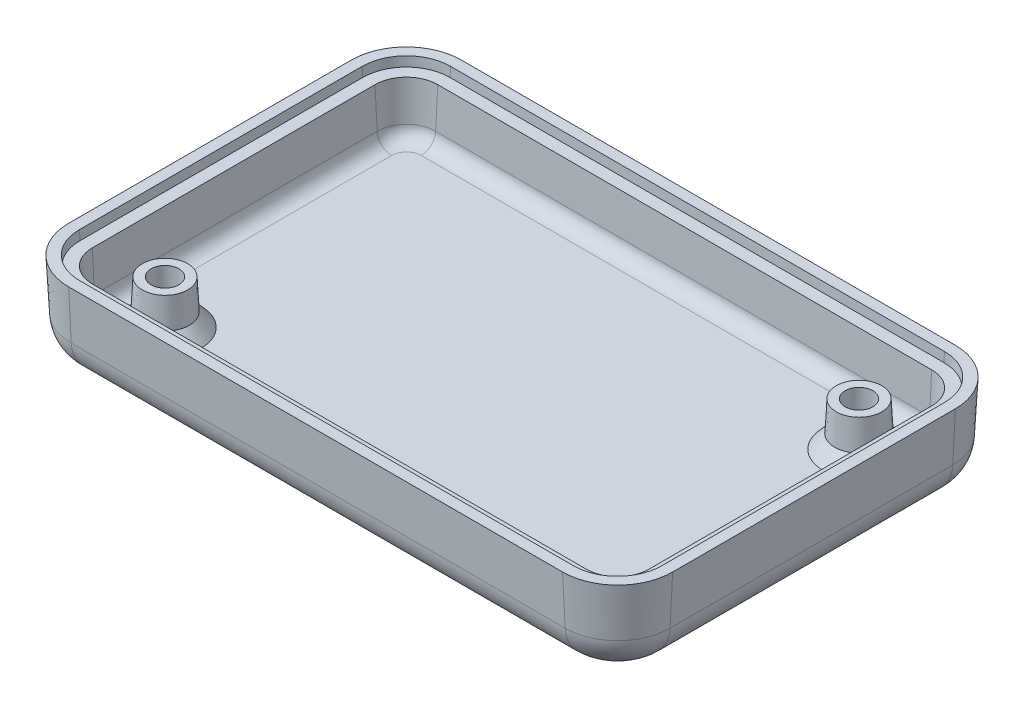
ISO-10303-21;
HEADER;
FILE_DESCRIPTION(('STEP AP214'),'2;1');
FILE_NAME('part.step','',(''),(''),'','','');
FILE_SCHEMA(('AUTOMOTIVE_DESIGN { 1 0 10303 214 1 1 1 1 }'));
ENDSEC;
DATA;
#1=APPLICATION_CONTEXT('core data for automotive mechanical design processes');
#2=APPLICATION_PROTOCOL_DEFINITION('international standard','automotive_design',2000,#1);
#3=PRODUCT_CONTEXT('',#1,'mechanical');
#4=PRODUCT('Part','Part','',(#3));
#5=PRODUCT_RELATED_PRODUCT_CATEGORY('part','',(#4));
#6=PRODUCT_DEFINITION_FORMATION('','',#4);
#7=PRODUCT_DEFINITION_CONTEXT('part definition',#1,'design');
#8=PRODUCT_DEFINITION('design','',#6,#7);
#9=PRODUCT_DEFINITION_SHAPE('','',#8);
#10=(LENGTH_UNIT() NAMED_UNIT(*) SI_UNIT(.MILLI.,.METRE.));
#11=(NAMED_UNIT(*) PLANE_ANGLE_UNIT() SI_UNIT($,.RADIAN.));
#12=(NAMED_UNIT(*) SI_UNIT($,.STERADIAN.) SOLID_ANGLE_UNIT());
#13=UNCERTAINTY_MEASURE_WITH_UNIT(LENGTH_MEASURE(1.E-05),#10,'distance_accuracy_value','');
#14=(GEOMETRIC_REPRESENTATION_CONTEXT(3) GLOBAL_UNCERTAINTY_ASSIGNED_CONTEXT((#13)) GLOBAL_UNIT_ASSIGNED_CONTEXT((#10,
#11,#12)) REPRESENTATION_CONTEXT('',''));
#15=CARTESIAN_POINT('',(0.,0.,0.));
#16=DIRECTION('',(0.,0.,1.));
#17=DIRECTION('',(1.,0.,0.));
#18=AXIS2_PLACEMENT_3D('',#15,#16,#17);
#19=CARTESIAN_POINT('',(25.9842000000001,-6.5786,14.8716999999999));
#20=DIRECTION('',(0.,1.,0.));
#21=DIRECTION('',(0.,0.,1.));
#22=AXIS2_PLACEMENT_3D('',#19,#20,#21);
#23=PLANE('',#22);
#24=CARTESIAN_POINT('',(23.8125,-6.5786,-12.7));
#25=DIRECTION('',(0.,1.,0.));
#26=DIRECTION('',(-0.830449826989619,0.,-0.557093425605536));
#27=AXIS2_PLACEMENT_3D('',#24,#25,#26);
#28=CIRCLE('',#27,3.81121688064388);
#29=CARTESIAN_POINT('',(27.5426618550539,-6.5786,-13.4818354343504));
#30=VERTEX_POINT('',#29);
#31=CARTESIAN_POINT('',(24.5943354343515,-6.5786,-16.4301618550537));
#32=VERTEX_POINT('',#31);
#33=EDGE_CURVE('E384',#30,#32,#28,.T.);
#34=ORIENTED_EDGE('',*,*,#33,.F.);
#35=DIRECTION('',(0.,0.,1.));
#36=VECTOR('',#35,1.);
#37=CARTESIAN_POINT('',(27.5426618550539,-6.5786,14.8716999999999));
#38=LINE('',#37,#36);
#39=CARTESIAN_POINT('',(27.5426618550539,-6.5786,-14.8716999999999));
#40=VERTEX_POINT('',#39);
#41=EDGE_CURVE('E461',#40,#30,#38,.T.);
#42=ORIENTED_EDGE('',*,*,#41,.F.);
#43=CARTESIAN_POINT('',(25.9842,-6.5786,-14.8716999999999));
#44=DIRECTION('',(0.,1.,0.));
#45=DIRECTION('',(0.,0.,1.));
#46=AXIS2_PLACEMENT_3D('',#43,#44,#45);
#47=CIRCLE('',#46,1.55846185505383);
#48=CARTESIAN_POINT('',(25.9842,-6.5786,-16.4301618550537));
#49=VERTEX_POINT('',#48);
#50=EDGE_CURVE('E454',#49,#40,#47,.F.);
#51=ORIENTED_EDGE('',*,*,#50,.F.);
#52=DIRECTION('',(1.,0.,0.));
#53=VECTOR('',#52,1.);
#54=CARTESIAN_POINT('',(25.9842000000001,-6.5786,-16.4301618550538));
#55=LINE('',#54,#53);
#56=EDGE_CURVE('E48',#32,#49,#55,.T.);
#57=ORIENTED_EDGE('',*,*,#56,.F.);
#58=EDGE_LOOP('',(#34,#42,#51,#57));
#59=FACE_BOUND('',#58,.T.);
#60=ADVANCED_FACE('F44',(#59),#23,.T.);
#61=CARTESIAN_POINT('',(23.0306645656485,-6.5786,-16.4301618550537));
#62=VERTEX_POINT('',#61);
#63=CARTESIAN_POINT('',(27.5426618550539,-6.5786,-11.9181645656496));
#64=VERTEX_POINT('',#63);
#65=EDGE_CURVE('E70',#62,#64,#28,.T.);
#66=ORIENTED_EDGE('',*,*,#65,.F.);
#67=CARTESIAN_POINT('',(-25.9842,-6.5786,-16.4301618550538));
#68=VERTEX_POINT('',#67);
#69=EDGE_CURVE('E451',#68,#62,#55,.T.);
#70=ORIENTED_EDGE('',*,*,#69,.F.);
#71=CARTESIAN_POINT('',(-25.9842,-6.5786,-14.8716999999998));
#72=DIRECTION('',(0.,1.,0.));
#73=DIRECTION('',(0.,0.,1.));
#74=AXIS2_PLACEMENT_3D('',#71,#72,#73);
#75=CIRCLE('',#74,1.55846185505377);
#76=CARTESIAN_POINT('',(-27.5426618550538,-6.5786,-14.8717));
#77=VERTEX_POINT('',#76);
#78=EDGE_CURVE('E460',#77,#68,#75,.F.);
#79=ORIENTED_EDGE('',*,*,#78,.F.);
#80=DIRECTION('',(0.,0.,1.));
#81=VECTOR('',#80,1.);
#82=CARTESIAN_POINT('',(-27.5426618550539,-6.5786,14.8716999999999));
#83=LINE('',#82,#81);
#84=CARTESIAN_POINT('',(-27.5426618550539,-6.5786,11.9181645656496));
#85=VERTEX_POINT('',#84);
#86=EDGE_CURVE('E630',#85,#77,#83,.F.);
#87=ORIENTED_EDGE('',*,*,#86,.F.);
#88=CARTESIAN_POINT('',(-23.8125,-6.5786,12.7));
#89=DIRECTION('',(0.,-1.,0.));
#90=DIRECTION('',(0.,0.,-1.));
#91=AXIS2_PLACEMENT_3D('',#88,#89,#90);
#92=CIRCLE('',#91,3.81121688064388);
#93=CARTESIAN_POINT('',(-23.030664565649,-6.5786,16.4301618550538));
#94=VERTEX_POINT('',#93);
#95=EDGE_CURVE('E621',#85,#94,#92,.T.);
#96=ORIENTED_EDGE('',*,*,#95,.T.);
#97=DIRECTION('',(1.,0.,0.));
#98=VECTOR('',#97,1.);
#99=CARTESIAN_POINT('',(25.9842000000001,-6.5786,16.4301618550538));
#100=LINE('',#99,#98);
#101=CARTESIAN_POINT('',(25.9842,-6.5786,16.4301618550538));
#102=VERTEX_POINT('',#101);
#103=EDGE_CURVE('E487',#102,#94,#100,.F.);
#104=ORIENTED_EDGE('',*,*,#103,.F.);
#105=CARTESIAN_POINT('',(25.9842000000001,-6.5786,14.8716999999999));
#106=DIRECTION('',(0.,1.,0.));
#107=DIRECTION('',(0.,0.,1.));
#108=AXIS2_PLACEMENT_3D('',#105,#106,#107);
#109=CIRCLE('',#108,1.55846185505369);
#110=CARTESIAN_POINT('',(27.5426618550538,-6.5786,14.8717));
#111=VERTEX_POINT('',#110);
#112=EDGE_CURVE('E491',#111,#102,#109,.F.);
#113=ORIENTED_EDGE('',*,*,#112,.F.);
#114=EDGE_CURVE('E468',#64,#111,#38,.T.);
#115=ORIENTED_EDGE('',*,*,#114,.F.);
#116=EDGE_LOOP('',(#66,#70,#79,#87,#96,#104,#113,#115));
#117=FACE_BOUND('',#116,.T.);
#118=ADVANCED_FACE('F530',(#117),#23,.T.);
#119=CARTESIAN_POINT('',(25.9842000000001,0.,14.8716999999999));
#120=DIRECTION('',(0.,1.,0.));
#121=DIRECTION('',(0.,0.,1.));
#122=AXIS2_PLACEMENT_3D('',#119,#120,#121);
#123=CONICAL_SURFACE('',#122,5.79119999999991,0.05235987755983);
#124=DIRECTION('',(0.,0.998629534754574,0.0523359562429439));
#125=VECTOR('',#124,1.);
#126=CARTESIAN_POINT('',(25.9841999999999,0.,20.6629));
#127=LINE('',#126,#125);
#128=CARTESIAN_POINT('',(25.9841999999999,-5.26197599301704,20.3871315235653));
#129=VERTEX_POINT('',#128);
#130=CARTESIAN_POINT('',(25.9841999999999,0.,20.6629));
#131=VERTEX_POINT('',#130);
#132=EDGE_CURVE('E739',#129,#131,#127,.T.);
#133=ORIENTED_EDGE('',*,*,#132,.F.);
#134=CARTESIAN_POINT('',(25.9842000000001,-5.26197599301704,14.8716999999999));
#135=DIRECTION('',(0.,1.,0.));
#136=DIRECTION('',(0.,0.,1.));
#137=AXIS2_PLACEMENT_3D('',#134,#135,#136);
#138=CIRCLE('',#137,5.51543152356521);
#139=CARTESIAN_POINT('',(31.4996315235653,-5.26197599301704,14.8717));
#140=VERTEX_POINT('',#139);
#141=EDGE_CURVE('E806',#129,#140,#138,.T.);
#142=ORIENTED_EDGE('',*,*,#141,.T.);
#143=DIRECTION('',(0.0523359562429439,0.998629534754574,0.));
#144=VECTOR('',#143,1.);
#145=CARTESIAN_POINT('',(31.7754,0.,14.8717));
#146=LINE('',#145,#144);
#147=CARTESIAN_POINT('',(31.7753999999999,0.,14.8717));
#148=VERTEX_POINT('',#147);
#149=EDGE_CURVE('E738',#140,#148,#146,.T.);
#150=ORIENTED_EDGE('',*,*,#149,.T.);
#151=CARTESIAN_POINT('',(25.9842000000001,0.,14.8716999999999));
#152=DIRECTION('',(0.,1.,0.));
#153=DIRECTION('',(0.,0.,1.));
#154=AXIS2_PLACEMENT_3D('',#151,#152,#153);
#155=CIRCLE('',#154,5.79119999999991);
#156=EDGE_CURVE('E705',#131,#148,#155,.T.);
#157=ORIENTED_EDGE('',*,*,#156,.F.);
#158=EDGE_LOOP('',(#133,#142,#150,#157));
#159=FACE_BOUND('',#158,.T.);
#160=ADVANCED_FACE('F526',(#159),#123,.T.);
#161=CARTESIAN_POINT('',(-25.9842000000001,0.,20.6629));
#162=DIRECTION('',(0.,-0.0523359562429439,0.998629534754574));
#163=DIRECTION('',(0.,-0.998629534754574,-0.052335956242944));
#164=AXIS2_PLACEMENT_3D('',#161,#162,#163);
#165=PLANE('',#164);
#166=DIRECTION('',(0.,0.998629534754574,0.0523359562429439));
#167=VECTOR('',#166,1.);
#168=CARTESIAN_POINT('',(-25.9842000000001,0.,20.6629));
#169=LINE('',#168,#167);
#170=CARTESIAN_POINT('',(-25.9842000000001,-5.26197599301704,20.3871315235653));
#171=VERTEX_POINT('',#170);
#172=CARTESIAN_POINT('',(-25.9842000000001,0.,20.6629));
#173=VERTEX_POINT('',#172);
#174=EDGE_CURVE('E743',#171,#173,#169,.T.);
#175=ORIENTED_EDGE('',*,*,#174,.F.);
#176=DIRECTION('',(1.,0.,0.));
#177=VECTOR('',#176,1.);
#178=CARTESIAN_POINT('',(25.9841999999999,-5.26197599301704,20.3871315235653));
#179=LINE('',#178,#177);
#180=EDGE_CURVE('E809',#171,#129,#179,.T.);
#181=ORIENTED_EDGE('',*,*,#180,.T.);
#182=ORIENTED_EDGE('',*,*,#132,.T.);
#183=DIRECTION('',(1.,0.,0.));
#184=VECTOR('',#183,1.);
#185=CARTESIAN_POINT('',(-25.9842000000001,0.,20.6629));
#186=LINE('',#185,#184);
#187=EDGE_CURVE('E734',#173,#131,#186,.T.);
#188=ORIENTED_EDGE('',*,*,#187,.F.);
#189=EDGE_LOOP('',(#175,#181,#182,#188));
#190=FACE_BOUND('',#189,.T.);
#191=ADVANCED_FACE('F529',(#190),#165,.T.);
#192=CARTESIAN_POINT('',(-25.9842000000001,0.,14.8717));
#193=DIRECTION('',(0.,1.,0.));
#194=DIRECTION('',(0.,0.,1.));
#195=AXIS2_PLACEMENT_3D('',#192,#193,#194);
#196=CONICAL_SURFACE('',#195,5.79120000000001,0.05235987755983);
#197=DIRECTION('',(-0.0523359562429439,0.998629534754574,0.));
#198=VECTOR('',#197,1.);
#199=CARTESIAN_POINT('',(-31.7754000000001,0.,14.8716999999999));
#200=LINE('',#199,#198);
#201=CARTESIAN_POINT('',(-31.4996315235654,-5.26197599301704,14.8716999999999));
#202=VERTEX_POINT('',#201);
#203=CARTESIAN_POINT('',(-31.7754000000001,0.,14.8716999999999));
#204=VERTEX_POINT('',#203);
#205=EDGE_CURVE('E758',#202,#204,#200,.T.);
#206=ORIENTED_EDGE('',*,*,#205,.F.);
#207=CARTESIAN_POINT('',(-25.9842000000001,-5.26197599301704,14.8717));
#208=DIRECTION('',(0.,1.,0.));
#209=DIRECTION('',(0.,0.,1.));
#210=AXIS2_PLACEMENT_3D('',#207,#208,#209);
#211=CIRCLE('',#210,5.51543152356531);
#212=EDGE_CURVE('E742',#202,#171,#211,.T.);
#213=ORIENTED_EDGE('',*,*,#212,.T.);
#214=ORIENTED_EDGE('',*,*,#174,.T.);
#215=CARTESIAN_POINT('',(-25.9842000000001,0.,14.8717));
#216=DIRECTION('',(0.,1.,0.));
#217=DIRECTION('',(0.,0.,1.));
#218=AXIS2_PLACEMENT_3D('',#215,#216,#217);
#219=CIRCLE('',#218,5.79120000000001);
#220=EDGE_CURVE('E730',#204,#173,#219,.T.);
#221=ORIENTED_EDGE('',*,*,#220,.F.);
#222=EDGE_LOOP('',(#206,#213,#214,#221));
#223=FACE_BOUND('',#222,.T.);
#224=ADVANCED_FACE('F550',(#223),#196,.T.);
#225=CARTESIAN_POINT('',(-31.7754000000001,0.,14.8716999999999));
#226=DIRECTION('',(-0.998629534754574,-0.0523359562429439,0.));
#227=DIRECTION('',(0.052335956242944,-0.998629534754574,0.));
#228=AXIS2_PLACEMENT_3D('',#225,#226,#227);
#229=PLANE('',#228);
#230=DIRECTION('',(-0.0523359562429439,0.998629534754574,0.));
#231=VECTOR('',#230,1.);
#232=CARTESIAN_POINT('',(-31.7754,0.,-14.8717));
#233=LINE('',#232,#231);
#234=CARTESIAN_POINT('',(-31.4996315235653,-5.26197599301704,-14.8717));
#235=VERTEX_POINT('',#234);
#236=CARTESIAN_POINT('',(-31.7754,0.,-14.8717));
#237=VERTEX_POINT('',#236);
#238=EDGE_CURVE('E755',#235,#237,#233,.T.);
#239=ORIENTED_EDGE('',*,*,#238,.F.);
#240=DIRECTION('',(0.,0.,1.));
#241=VECTOR('',#240,1.);
#242=CARTESIAN_POINT('',(-31.4996315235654,-5.26197599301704,14.8716999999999));
#243=LINE('',#242,#241);
#244=EDGE_CURVE('E791',#235,#202,#243,.T.);
#245=ORIENTED_EDGE('',*,*,#244,.T.);
#246=ORIENTED_EDGE('',*,*,#205,.T.);
#247=DIRECTION('',(0.,0.,1.));
#248=VECTOR('',#247,1.);
#249=CARTESIAN_POINT('',(-31.7754000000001,0.,14.8716999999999));
#250=LINE('',#249,#248);
#251=EDGE_CURVE('E726',#237,#204,#250,.T.);
#252=ORIENTED_EDGE('',*,*,#251,.F.);
#253=EDGE_LOOP('',(#239,#245,#246,#252));
#254=FACE_BOUND('',#253,.T.);
#255=ADVANCED_FACE('F546',(#254),#229,.T.);
#256=CARTESIAN_POINT('',(-25.9842,0.,-14.8716999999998));
#257=DIRECTION('',(0.,1.,0.));
#258=DIRECTION('',(0.,0.,1.));
#259=AXIS2_PLACEMENT_3D('',#256,#257,#258);
#260=CONICAL_SURFACE('',#259,5.79119999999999,0.05235987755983);
#261=DIRECTION('',(0.,0.998629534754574,-0.0523359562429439));
#262=VECTOR('',#261,1.);
#263=CARTESIAN_POINT('',(-25.9841999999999,0.,-20.6629));
#264=LINE('',#263,#262);
#265=CARTESIAN_POINT('',(-25.9841999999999,-5.26197599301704,-20.3871315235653));
#266=VERTEX_POINT('',#265);
#267=CARTESIAN_POINT('',(-25.9841999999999,0.,-20.6629));
#268=VERTEX_POINT('',#267);
#269=EDGE_CURVE('E752',#266,#268,#264,.T.);
#270=ORIENTED_EDGE('',*,*,#269,.F.);
#271=CARTESIAN_POINT('',(-25.9842,-5.26197599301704,-14.8716999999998));
#272=DIRECTION('',(0.,1.,0.));
#273=DIRECTION('',(0.,0.,1.));
#274=AXIS2_PLACEMENT_3D('',#271,#272,#273);
#275=CIRCLE('',#274,5.5154315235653);
#276=EDGE_CURVE('E794',#266,#235,#275,.T.);
#277=ORIENTED_EDGE('',*,*,#276,.T.);
#278=ORIENTED_EDGE('',*,*,#238,.T.);
#279=CARTESIAN_POINT('',(-25.9842,0.,-14.8716999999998));
#280=DIRECTION('',(0.,1.,0.));
#281=DIRECTION('',(0.,0.,1.));
#282=AXIS2_PLACEMENT_3D('',#279,#280,#281);
#283=CIRCLE('',#282,5.79119999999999);
#284=EDGE_CURVE('E722',#268,#237,#283,.T.);
#285=ORIENTED_EDGE('',*,*,#284,.F.);
#286=EDGE_LOOP('',(#270,#277,#278,#285));
#287=FACE_BOUND('',#286,.T.);
#288=ADVANCED_FACE('F542',(#287),#260,.T.);
#289=CARTESIAN_POINT('',(-25.9841999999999,0.,-20.6629));
#290=DIRECTION('',(0.,-0.0523359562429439,-0.998629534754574));
#291=DIRECTION('',(0.,0.998629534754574,-0.052335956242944));
#292=AXIS2_PLACEMENT_3D('',#289,#290,#291);
#293=PLANE('',#292);
#294=DIRECTION('',(0.,0.998629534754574,-0.0523359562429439));
#295=VECTOR('',#294,1.);
#296=CARTESIAN_POINT('',(25.9842,0.,-20.6628999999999));
#297=LINE('',#296,#295);
#298=CARTESIAN_POINT('',(25.9842,-5.26197599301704,-20.3871315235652));
#299=VERTEX_POINT('',#298);
#300=CARTESIAN_POINT('',(25.9842,0.,-20.6628999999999));
#301=VERTEX_POINT('',#300);
#302=EDGE_CURVE('E749',#299,#301,#297,.T.);
#303=ORIENTED_EDGE('',*,*,#302,.F.);
#304=DIRECTION('',(-1.,0.,0.));
#305=VECTOR('',#304,1.);
#306=CARTESIAN_POINT('',(-25.9841999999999,-5.26197599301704,-20.3871315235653));
#307=LINE('',#306,#305);
#308=EDGE_CURVE('E797',#299,#266,#307,.T.);
#309=ORIENTED_EDGE('',*,*,#308,.T.);
#310=ORIENTED_EDGE('',*,*,#269,.T.);
#311=DIRECTION('',(-1.,0.,0.));
#312=VECTOR('',#311,1.);
#313=CARTESIAN_POINT('',(-25.9841999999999,0.,-20.6629));
#314=LINE('',#313,#312);
#315=EDGE_CURVE('E718',#301,#268,#314,.T.);
#316=ORIENTED_EDGE('',*,*,#315,.F.);
#317=EDGE_LOOP('',(#303,#309,#310,#316));
#318=FACE_BOUND('',#317,.T.);
#319=ADVANCED_FACE('F538',(#318),#293,.T.);
#320=CARTESIAN_POINT('',(25.9842,0.,-14.8716999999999));
#321=DIRECTION('',(0.,1.,0.));
#322=DIRECTION('',(0.,0.,1.));
#323=AXIS2_PLACEMENT_3D('',#320,#321,#322);
#324=CONICAL_SURFACE('',#323,5.79120000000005,0.05235987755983);
#325=DIRECTION('',(0.0523359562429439,0.998629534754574,0.));
#326=VECTOR('',#325,1.);
#327=CARTESIAN_POINT('',(31.7754000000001,0.,-14.8716999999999));
#328=LINE('',#327,#326);
#329=CARTESIAN_POINT('',(31.4996315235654,-5.26197599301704,-14.8716999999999));
#330=VERTEX_POINT('',#329);
#331=CARTESIAN_POINT('',(31.7754000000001,0.,-14.8716999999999));
#332=VERTEX_POINT('',#331);
#333=EDGE_CURVE('E746',#330,#332,#328,.T.);
#334=ORIENTED_EDGE('',*,*,#333,.F.);
#335=CARTESIAN_POINT('',(25.9842,-5.26197599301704,-14.8716999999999));
#336=DIRECTION('',(0.,1.,0.));
#337=DIRECTION('',(0.,0.,1.));
#338=AXIS2_PLACEMENT_3D('',#335,#336,#337);
#339=CIRCLE('',#338,5.51543152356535);
#340=EDGE_CURVE('E800',#330,#299,#339,.T.);
#341=ORIENTED_EDGE('',*,*,#340,.T.);
#342=ORIENTED_EDGE('',*,*,#302,.T.);
#343=CARTESIAN_POINT('',(25.9842,0.,-14.8716999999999));
#344=DIRECTION('',(0.,1.,0.));
#345=DIRECTION('',(0.,0.,1.));
#346=AXIS2_PLACEMENT_3D('',#343,#344,#345);
#347=CIRCLE('',#346,5.79120000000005);
#348=EDGE_CURVE('E714',#332,#301,#347,.T.);
#349=ORIENTED_EDGE('',*,*,#348,.F.);
#350=EDGE_LOOP('',(#334,#341,#342,#349));
#351=FACE_BOUND('',#350,.T.);
#352=ADVANCED_FACE('F534',(#351),#324,.T.);
#353=CARTESIAN_POINT('',(31.7753999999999,0.,14.8717));
#354=DIRECTION('',(0.998629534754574,-0.0523359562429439,0.));
#355=DIRECTION('',(0.052335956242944,0.998629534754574,0.));
#356=AXIS2_PLACEMENT_3D('',#353,#354,#355);
#357=PLANE('',#356);
#358=ORIENTED_EDGE('',*,*,#149,.F.);
#359=DIRECTION('',(0.,0.,-1.));
#360=VECTOR('',#359,1.);
#361=CARTESIAN_POINT('',(31.4996315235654,-5.26197599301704,-14.8716999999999));
#362=LINE('',#361,#360);
#363=EDGE_CURVE('E803',#140,#330,#362,.T.);
#364=ORIENTED_EDGE('',*,*,#363,.T.);
#365=ORIENTED_EDGE('',*,*,#333,.T.);
#366=DIRECTION('',(0.,0.,-1.));
#367=VECTOR('',#366,1.);
#368=CARTESIAN_POINT('',(31.7753999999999,0.,14.8717));
#369=LINE('',#368,#367);
#370=EDGE_CURVE('E709',#148,#332,#369,.T.);
#371=ORIENTED_EDGE('',*,*,#370,.F.);
#372=EDGE_LOOP('',(#358,#364,#365,#371));
#373=FACE_BOUND('',#372,.T.);
#374=ADVANCED_FACE('F521',(#373),#357,.T.);
#375=CARTESIAN_POINT('',(25.9842000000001,-9.017,14.8716999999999));
#376=DIRECTION('',(0.,1.,0.));
#377=DIRECTION('',(0.,0.,1.));
#378=AXIS2_PLACEMENT_3D('',#375,#376,#377);
#379=PLANE('',#378);
#380=DIRECTION('',(1.,0.,0.));
#381=VECTOR('',#380,1.);
#382=CARTESIAN_POINT('',(-12.9794,-9.017,-13.0302));
#383=LINE('',#382,#381);
#384=CARTESIAN_POINT('',(-12.9794,-9.017,-13.0302));
#385=VERTEX_POINT('',#384);
#386=CARTESIAN_POINT('',(19.431,-9.017,-13.0302));
#387=VERTEX_POINT('',#386);
#388=EDGE_CURVE('E340',#385,#387,#383,.T.);
#389=ORIENTED_EDGE('',*,*,#388,.F.);
#390=DIRECTION('',(0.,0.,-1.));
#391=VECTOR('',#390,1.);
#392=CARTESIAN_POINT('',(-12.9794,-9.017,-13.0302));
#393=LINE('',#392,#391);
#394=CARTESIAN_POINT('',(-12.9794,-9.017,13.0302));
#395=VERTEX_POINT('',#394);
#396=EDGE_CURVE('E62',#395,#385,#393,.T.);
#397=ORIENTED_EDGE('',*,*,#396,.F.);
#398=DIRECTION('',(-1.,0.,0.));
#399=VECTOR('',#398,1.);
#400=CARTESIAN_POINT('',(-12.9794,-9.017,13.0302));
#401=LINE('',#400,#399);
#402=CARTESIAN_POINT('',(19.431,-9.017,13.0302));
#403=VERTEX_POINT('',#402);
#404=EDGE_CURVE('E326',#403,#395,#401,.T.);
#405=ORIENTED_EDGE('',*,*,#404,.F.);
#406=DIRECTION('',(0.,0.,1.));
#407=VECTOR('',#406,1.);
#408=CARTESIAN_POINT('',(19.431,-9.017,-13.0302));
#409=LINE('',#408,#407);
#410=EDGE_CURVE('E331',#387,#403,#409,.T.);
#411=ORIENTED_EDGE('',*,*,#410,.F.);
#412=EDGE_LOOP('',(#389,#397,#405,#411));
#413=FACE_BOUND('',#412,.T.);
#414=CARTESIAN_POINT('',(23.8125,-9.017,-12.7));
#415=DIRECTION('',(0.,1.,0.));
#416=DIRECTION('',(-0.830449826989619,0.,-0.557093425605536));
#417=AXIS2_PLACEMENT_3D('',#414,#415,#416);
#418=CIRCLE('',#417,2.92385623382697);
#419=CARTESIAN_POINT('',(21.3843840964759,-9.017,-14.3288610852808));
#420=VERTEX_POINT('',#419);
#421=EDGE_CURVE('E349',#420,#420,#418,.T.);
#422=ORIENTED_EDGE('',*,*,#421,.T.);
#423=EDGE_LOOP('',(#422));
#424=FACE_BOUND('',#423,.T.);
#425=CARTESIAN_POINT('',(-23.8125,-9.017,12.7));
#426=DIRECTION('',(0.,-1.,0.));
#427=DIRECTION('',(0.,0.,-1.));
#428=AXIS2_PLACEMENT_3D('',#425,#426,#427);
#429=CIRCLE('',#428,2.92385623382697);
#430=CARTESIAN_POINT('',(-23.8125,-9.017,9.77614376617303));
#431=VERTEX_POINT('',#430);
#432=EDGE_CURVE('E396',#431,#431,#429,.T.);
#433=ORIENTED_EDGE('',*,*,#432,.F.);
#434=EDGE_LOOP('',(#433));
#435=FACE_BOUND('',#434,.T.);
#436=DIRECTION('',(1.,0.,0.));
#437=VECTOR('',#436,1.);
#438=CARTESIAN_POINT('',(-25.9842000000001,-9.017,16.4301618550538));
#439=LINE('',#438,#437);
#440=CARTESIAN_POINT('',(25.9842,-9.017,16.4301618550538));
#441=VERTEX_POINT('',#440);
#442=CARTESIAN_POINT('',(-25.9842000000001,-9.017,16.4301618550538));
#443=VERTEX_POINT('',#442);
#444=EDGE_CURVE('E766',#441,#443,#439,.F.);
#445=ORIENTED_EDGE('',*,*,#444,.T.);
#446=CARTESIAN_POINT('',(-25.9842000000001,-9.017,14.8717));
#447=DIRECTION('',(0.,1.,0.));
#448=DIRECTION('',(0.,0.,1.));
#449=AXIS2_PLACEMENT_3D('',#446,#447,#448);
#450=CIRCLE('',#449,1.55846185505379);
#451=CARTESIAN_POINT('',(-27.5426618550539,-9.017,14.8716999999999));
#452=VERTEX_POINT('',#451);
#453=EDGE_CURVE('E787',#443,#452,#450,.F.);
#454=ORIENTED_EDGE('',*,*,#453,.T.);
#455=DIRECTION('',(0.,0.,1.));
#456=VECTOR('',#455,1.);
#457=CARTESIAN_POINT('',(-27.5426618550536,-9.017,-14.8717));
#458=LINE('',#457,#456);
#459=CARTESIAN_POINT('',(-27.5426618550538,-9.017,-14.8717));
#460=VERTEX_POINT('',#459);
#461=EDGE_CURVE('E784',#452,#460,#458,.F.);
#462=ORIENTED_EDGE('',*,*,#461,.T.);
#463=CARTESIAN_POINT('',(-25.9842,-9.017,-14.8716999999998));
#464=DIRECTION('',(0.,1.,0.));
#465=DIRECTION('',(0.,0.,1.));
#466=AXIS2_PLACEMENT_3D('',#463,#464,#465);
#467=CIRCLE('',#466,1.55846185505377);
#468=CARTESIAN_POINT('',(-25.9842,-9.017,-16.4301618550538));
#469=VERTEX_POINT('',#468);
#470=EDGE_CURVE('E781',#460,#469,#467,.F.);
#471=ORIENTED_EDGE('',*,*,#470,.T.);
#472=DIRECTION('',(-1.,0.,0.));
#473=VECTOR('',#472,1.);
#474=CARTESIAN_POINT('',(25.9842,-9.017,-16.4301618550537));
#475=LINE('',#474,#473);
#476=CARTESIAN_POINT('',(25.9842,-9.017,-16.4301618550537));
#477=VERTEX_POINT('',#476);
#478=EDGE_CURVE('E778',#469,#477,#475,.F.);
#479=ORIENTED_EDGE('',*,*,#478,.T.);
#480=CARTESIAN_POINT('',(25.9842,-9.017,-14.8716999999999));
#481=DIRECTION('',(0.,1.,0.));
#482=DIRECTION('',(0.,0.,1.));
#483=AXIS2_PLACEMENT_3D('',#480,#481,#482);
#484=CIRCLE('',#483,1.55846185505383);
#485=CARTESIAN_POINT('',(27.5426618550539,-9.017,-14.8716999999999));
#486=VERTEX_POINT('',#485);
#487=EDGE_CURVE('E775',#477,#486,#484,.F.);
#488=ORIENTED_EDGE('',*,*,#487,.T.);
#489=DIRECTION('',(0.,0.,-1.));
#490=VECTOR('',#489,1.);
#491=CARTESIAN_POINT('',(27.5426618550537,-9.017,14.8717));
#492=LINE('',#491,#490);
#493=CARTESIAN_POINT('',(27.5426618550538,-9.017,14.8717));
#494=VERTEX_POINT('',#493);
#495=EDGE_CURVE('E772',#486,#494,#492,.F.);
#496=ORIENTED_EDGE('',*,*,#495,.T.);
#497=CARTESIAN_POINT('',(25.9842000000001,-9.017,14.8716999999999));
#498=DIRECTION('',(0.,1.,0.));
#499=DIRECTION('',(0.,0.,1.));
#500=AXIS2_PLACEMENT_3D('',#497,#498,#499);
#501=CIRCLE('',#500,1.55846185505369);
#502=EDGE_CURVE('E769',#494,#441,#501,.F.);
#503=ORIENTED_EDGE('',*,*,#502,.T.);
#504=EDGE_LOOP('',(#445,#454,#462,#471,#479,#488,#496,#503));
#505=FACE_BOUND('',#504,.T.);
#506=ADVANCED_FACE('F517',(#413,#424,#435,#505),#379,.F.);
#507=CARTESIAN_POINT('',(25.9842000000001,0.,14.8716999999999));
#508=DIRECTION('',(0.,1.,0.));
#509=DIRECTION('',(0.,0.,1.));
#510=AXIS2_PLACEMENT_3D('',#507,#508,#509);
#511=PLANE('',#510);
#512=CARTESIAN_POINT('',(-25.9842,0.,-14.8716999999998));
#513=DIRECTION('',(0.,1.,0.));
#514=DIRECTION('',(0.,0.,1.));
#515=AXIS2_PLACEMENT_3D('',#512,#513,#514);
#516=CIRCLE('',#515,4.64820000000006);
#517=CARTESIAN_POINT('',(-25.9841999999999,0.,-19.5198999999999));
#518=VERTEX_POINT('',#517);
#519=CARTESIAN_POINT('',(-30.6324000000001,0.,-14.8717));
#520=VERTEX_POINT('',#519);
#521=EDGE_CURVE('E970',#518,#520,#516,.T.);
#522=ORIENTED_EDGE('',*,*,#521,.F.);
#523=DIRECTION('',(-1.,0.,0.));
#524=VECTOR('',#523,1.);
#525=CARTESIAN_POINT('',(25.9842,0.,-19.5199));
#526=LINE('',#525,#524);
#527=CARTESIAN_POINT('',(25.9842,0.,-19.5199));
#528=VERTEX_POINT('',#527);
#529=EDGE_CURVE('E1002',#528,#518,#526,.T.);
#530=ORIENTED_EDGE('',*,*,#529,.F.);
#531=CARTESIAN_POINT('',(25.9842,0.,-14.8716999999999));
#532=DIRECTION('',(0.,1.,0.));
#533=DIRECTION('',(0.,0.,1.));
#534=AXIS2_PLACEMENT_3D('',#531,#532,#533);
#535=CIRCLE('',#534,4.64820000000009);
#536=CARTESIAN_POINT('',(30.6324000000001,0.,-14.8716999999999));
#537=VERTEX_POINT('',#536);
#538=EDGE_CURVE('E998',#537,#528,#535,.T.);
#539=ORIENTED_EDGE('',*,*,#538,.F.);
#540=DIRECTION('',(0.,0.,-1.));
#541=VECTOR('',#540,1.);
#542=CARTESIAN_POINT('',(30.6324,0.,14.8717));
#543=LINE('',#542,#541);
#544=CARTESIAN_POINT('',(30.6324,0.,14.8717));
#545=VERTEX_POINT('',#544);
#546=EDGE_CURVE('E994',#545,#537,#543,.T.);
#547=ORIENTED_EDGE('',*,*,#546,.F.);
#548=CARTESIAN_POINT('',(25.9842000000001,0.,14.8716999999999));
#549=DIRECTION('',(0.,1.,0.));
#550=DIRECTION('',(0.,0.,1.));
#551=AXIS2_PLACEMENT_3D('',#548,#549,#550);
#552=CIRCLE('',#551,4.64819999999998);
#553=CARTESIAN_POINT('',(25.9841999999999,0.,19.5198999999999));
#554=VERTEX_POINT('',#553);
#555=EDGE_CURVE('E990',#554,#545,#552,.T.);
#556=ORIENTED_EDGE('',*,*,#555,.F.);
#557=DIRECTION('',(1.,0.,0.));
#558=VECTOR('',#557,1.);
#559=CARTESIAN_POINT('',(-25.9842000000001,0.,19.5199));
#560=LINE('',#559,#558);
#561=CARTESIAN_POINT('',(-25.9842000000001,0.,19.5199));
#562=VERTEX_POINT('',#561);
#563=EDGE_CURVE('E986',#562,#554,#560,.T.);
#564=ORIENTED_EDGE('',*,*,#563,.F.);
#565=CARTESIAN_POINT('',(-25.9842000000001,0.,14.8717));
#566=DIRECTION('',(0.,1.,0.));
#567=DIRECTION('',(0.,0.,1.));
#568=AXIS2_PLACEMENT_3D('',#565,#566,#567);
#569=CIRCLE('',#568,4.6482);
#570=CARTESIAN_POINT('',(-30.6324000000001,0.,14.8716999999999));
#571=VERTEX_POINT('',#570);
#572=EDGE_CURVE('E982',#571,#562,#569,.T.);
#573=ORIENTED_EDGE('',*,*,#572,.F.);
#574=DIRECTION('',(0.,0.,1.));
#575=VECTOR('',#574,1.);
#576=CARTESIAN_POINT('',(-30.6324000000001,0.,-14.8717));
#577=LINE('',#576,#575);
#578=EDGE_CURVE('E978',#520,#571,#577,.T.);
#579=ORIENTED_EDGE('',*,*,#578,.F.);
#580=EDGE_LOOP('',(#522,#530,#539,#547,#556,#564,#573,#579));
#581=FACE_BOUND('',#580,.T.);
#582=ORIENTED_EDGE('',*,*,#156,.T.);
#583=ORIENTED_EDGE('',*,*,#370,.T.);
#584=ORIENTED_EDGE('',*,*,#348,.T.);
#585=ORIENTED_EDGE('',*,*,#315,.T.);
#586=ORIENTED_EDGE('',*,*,#284,.T.);
#587=ORIENTED_EDGE('',*,*,#251,.T.);
#588=ORIENTED_EDGE('',*,*,#220,.T.);
#589=ORIENTED_EDGE('',*,*,#187,.T.);
#590=EDGE_LOOP('',(#582,#583,#584,#585,#586,#587,#588,#589));
#591=FACE_BOUND('',#590,.T.);
#592=ADVANCED_FACE('F520',(#581,#591),#511,.T.);
#593=CARTESIAN_POINT('',(25.9842,-5.0546,-14.8716999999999));
#594=DIRECTION('',(0.,1.,0.));
#595=DIRECTION('',(0.,0.,1.));
#596=AXIS2_PLACEMENT_3D('',#593,#594,#595);
#597=DEGENERATE_TOROIDAL_SURFACE('',#596,1.55846185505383,3.9624,.T.);
#598=CARTESIAN_POINT('',(27.5426618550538,-5.0546,-14.8716999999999));
#599=DIRECTION('',(0.,0.,1.));
#600=DIRECTION('',(1.,0.,0.));
#601=AXIS2_PLACEMENT_3D('',#598,#599,#600);
#602=CIRCLE('',#601,3.9624);
#603=EDGE_CURVE('E836',#486,#330,#602,.T.);
#604=ORIENTED_EDGE('',*,*,#603,.F.);
#605=ORIENTED_EDGE('',*,*,#487,.F.);
#606=CARTESIAN_POINT('',(25.9842,-5.0546,-16.4301618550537));
#607=DIRECTION('',(-1.,0.,0.));
#608=DIRECTION('',(0.,0.,1.));
#609=AXIS2_PLACEMENT_3D('',#606,#607,#608);
#610=CIRCLE('',#609,3.9624);
#611=EDGE_CURVE('E710',#299,#477,#610,.T.);
#612=ORIENTED_EDGE('',*,*,#611,.F.);
#613=ORIENTED_EDGE('',*,*,#340,.F.);
#614=EDGE_LOOP('',(#604,#605,#612,#613));
#615=FACE_BOUND('',#614,.T.);
#616=ADVANCED_FACE('F46',(#615),#597,.T.);
#617=CARTESIAN_POINT('',(-25.9841999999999,-5.0546,-16.4301618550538));
#618=DIRECTION('',(1.,0.,0.));
#619=DIRECTION('',(0.,0.,-1.));
#620=AXIS2_PLACEMENT_3D('',#617,#618,#619);
#621=CYLINDRICAL_SURFACE('',#620,3.9624);
#622=ORIENTED_EDGE('',*,*,#611,.T.);
#623=ORIENTED_EDGE('',*,*,#478,.F.);
#624=CARTESIAN_POINT('',(-25.9841999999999,-5.0546,-16.4301618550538));
#625=DIRECTION('',(-1.,0.,0.));
#626=DIRECTION('',(0.,-1.,0.));
#627=AXIS2_PLACEMENT_3D('',#624,#625,#626);
#628=CIRCLE('',#627,3.9624);
#629=EDGE_CURVE('E832',#266,#469,#628,.T.);
#630=ORIENTED_EDGE('',*,*,#629,.F.);
#631=ORIENTED_EDGE('',*,*,#308,.F.);
#632=EDGE_LOOP('',(#622,#623,#630,#631));
#633=FACE_BOUND('',#632,.T.);
#634=ADVANCED_FACE('F581',(#633),#621,.T.);
#635=CARTESIAN_POINT('',(27.5426618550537,-5.0546,14.8717));
#636=DIRECTION('',(0.,0.,1.));
#637=DIRECTION('',(1.,0.,0.));
#638=AXIS2_PLACEMENT_3D('',#635,#636,#637);
#639=CYLINDRICAL_SURFACE('',#638,3.9624);
#640=ORIENTED_EDGE('',*,*,#603,.T.);
#641=ORIENTED_EDGE('',*,*,#363,.F.);
#642=CARTESIAN_POINT('',(27.5426618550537,-5.0546,14.8717));
#643=DIRECTION('',(0.,0.,1.));
#644=DIRECTION('',(1.,0.,0.));
#645=AXIS2_PLACEMENT_3D('',#642,#643,#644);
#646=CIRCLE('',#645,3.9624);
#647=EDGE_CURVE('E828',#494,#140,#646,.T.);
#648=ORIENTED_EDGE('',*,*,#647,.F.);
#649=ORIENTED_EDGE('',*,*,#495,.F.);
#650=EDGE_LOOP('',(#640,#641,#648,#649));
#651=FACE_BOUND('',#650,.T.);
#652=ADVANCED_FACE('F578',(#651),#639,.T.);
#653=CARTESIAN_POINT('',(-25.9842,-5.0546,-14.8716999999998));
#654=DIRECTION('',(0.,1.,0.));
#655=DIRECTION('',(0.,0.,1.));
#656=AXIS2_PLACEMENT_3D('',#653,#654,#655);
#657=DEGENERATE_TOROIDAL_SURFACE('',#656,1.55846185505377,3.9624,.T.);
#658=ORIENTED_EDGE('',*,*,#629,.T.);
#659=ORIENTED_EDGE('',*,*,#470,.F.);
#660=CARTESIAN_POINT('',(-27.5426618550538,-5.0546,-14.8716999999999));
#661=DIRECTION('',(0.,0.,1.));
#662=DIRECTION('',(1.,0.,0.));
#663=AXIS2_PLACEMENT_3D('',#660,#661,#662);
#664=CIRCLE('',#663,3.9624);
#665=EDGE_CURVE('E824',#235,#460,#664,.T.);
#666=ORIENTED_EDGE('',*,*,#665,.F.);
#667=ORIENTED_EDGE('',*,*,#276,.F.);
#668=EDGE_LOOP('',(#658,#659,#666,#667));
#669=FACE_BOUND('',#668,.T.);
#670=ADVANCED_FACE('F574',(#669),#657,.T.);
#671=CARTESIAN_POINT('',(25.9842000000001,-5.0546,14.8716999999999));
#672=DIRECTION('',(0.,1.,0.));
#673=DIRECTION('',(0.,0.,1.));
#674=AXIS2_PLACEMENT_3D('',#671,#672,#673);
#675=DEGENERATE_TOROIDAL_SURFACE('',#674,1.55846185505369,3.9624,.T.);
#676=ORIENTED_EDGE('',*,*,#647,.T.);
#677=ORIENTED_EDGE('',*,*,#141,.F.);
#678=CARTESIAN_POINT('',(25.9842,-5.0546,16.4301618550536));
#679=DIRECTION('',(-1.,0.,0.));
#680=DIRECTION('',(0.,0.,1.));
#681=AXIS2_PLACEMENT_3D('',#678,#679,#680);
#682=CIRCLE('',#681,3.9624);
#683=EDGE_CURVE('E820',#441,#129,#682,.T.);
#684=ORIENTED_EDGE('',*,*,#683,.F.);
#685=ORIENTED_EDGE('',*,*,#502,.F.);
#686=EDGE_LOOP('',(#676,#677,#684,#685));
#687=FACE_BOUND('',#686,.T.);
#688=ADVANCED_FACE('F570',(#687),#675,.T.);
#689=CARTESIAN_POINT('',(-27.5426618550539,-5.0546,14.8716999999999));
#690=DIRECTION('',(0.,0.,-1.));
#691=DIRECTION('',(-1.,0.,0.));
#692=AXIS2_PLACEMENT_3D('',#689,#690,#691);
#693=CYLINDRICAL_SURFACE('',#692,3.9624);
#694=ORIENTED_EDGE('',*,*,#665,.T.);
#695=ORIENTED_EDGE('',*,*,#461,.F.);
#696=CARTESIAN_POINT('',(-27.5426618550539,-5.0546,14.8716999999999));
#697=DIRECTION('',(0.,0.,1.));
#698=DIRECTION('',(1.,0.,0.));
#699=AXIS2_PLACEMENT_3D('',#696,#697,#698);
#700=CIRCLE('',#699,3.9624);
#701=EDGE_CURVE('E816',#202,#452,#700,.T.);
#702=ORIENTED_EDGE('',*,*,#701,.F.);
#703=ORIENTED_EDGE('',*,*,#244,.F.);
#704=EDGE_LOOP('',(#694,#695,#702,#703));
#705=FACE_BOUND('',#704,.T.);
#706=ADVANCED_FACE('F566',(#705),#693,.T.);
#707=CARTESIAN_POINT('',(-25.9842000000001,-5.0546,16.4301618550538));
#708=DIRECTION('',(-1.,0.,0.));
#709=DIRECTION('',(0.,0.,1.));
#710=AXIS2_PLACEMENT_3D('',#707,#708,#709);
#711=CYLINDRICAL_SURFACE('',#710,3.9624);
#712=ORIENTED_EDGE('',*,*,#683,.T.);
#713=ORIENTED_EDGE('',*,*,#180,.F.);
#714=CARTESIAN_POINT('',(-25.9842000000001,-5.0546,16.4301618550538));
#715=DIRECTION('',(-1.,0.,0.));
#716=DIRECTION('',(0.,0.,1.));
#717=AXIS2_PLACEMENT_3D('',#714,#715,#716);
#718=CIRCLE('',#717,3.9624);
#719=EDGE_CURVE('E813',#443,#171,#718,.T.);
#720=ORIENTED_EDGE('',*,*,#719,.F.);
#721=ORIENTED_EDGE('',*,*,#444,.F.);
#722=EDGE_LOOP('',(#712,#713,#720,#721));
#723=FACE_BOUND('',#722,.T.);
#724=ADVANCED_FACE('F562',(#723),#711,.T.);
#725=CARTESIAN_POINT('',(-25.9842000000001,-5.0546,14.8717));
#726=DIRECTION('',(0.,1.,0.));
#727=DIRECTION('',(0.,0.,1.));
#728=AXIS2_PLACEMENT_3D('',#725,#726,#727);
#729=DEGENERATE_TOROIDAL_SURFACE('',#728,1.55846185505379,3.9624,.T.);
#730=ORIENTED_EDGE('',*,*,#701,.T.);
#731=ORIENTED_EDGE('',*,*,#453,.F.);
#732=ORIENTED_EDGE('',*,*,#719,.T.);
#733=ORIENTED_EDGE('',*,*,#212,.F.);
#734=EDGE_LOOP('',(#730,#731,#732,#733));
#735=FACE_BOUND('',#734,.T.);
#736=ADVANCED_FACE('F558',(#735),#729,.T.);
#737=CARTESIAN_POINT('',(-25.9842,-0.9906,-14.8716999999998));
#738=DIRECTION('',(0.,1.,0.));
#739=DIRECTION('',(0.,0.,1.));
#740=AXIS2_PLACEMENT_3D('',#737,#738,#739);
#741=PLANE('',#740);
#742=CARTESIAN_POINT('',(-25.9842,-0.9906,-14.8716999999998));
#743=DIRECTION('',(0.,1.,0.));
#744=DIRECTION('',(0.,0.,1.));
#745=AXIS2_PLACEMENT_3D('',#742,#743,#744);
#746=CIRCLE('',#745,4.59628485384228);
#747=CARTESIAN_POINT('',(-25.9841999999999,-0.9906,-19.4679848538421));
#748=VERTEX_POINT('',#747);
#749=CARTESIAN_POINT('',(-30.5804848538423,-0.9906,-14.8717));
#750=VERTEX_POINT('',#749);
#751=EDGE_CURVE('E1006',#748,#750,#746,.T.);
#752=ORIENTED_EDGE('',*,*,#751,.T.);
#753=DIRECTION('',(0.,0.,1.));
#754=VECTOR('',#753,1.);
#755=CARTESIAN_POINT('',(-30.5804848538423,-0.9906,-14.8716999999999));
#756=LINE('',#755,#754);
#757=CARTESIAN_POINT('',(-30.5804848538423,-0.9906,14.8716999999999));
#758=VERTEX_POINT('',#757);
#759=EDGE_CURVE('E1036',#750,#758,#756,.T.);
#760=ORIENTED_EDGE('',*,*,#759,.T.);
#761=CARTESIAN_POINT('',(-25.9842000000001,-0.9906,14.8717));
#762=DIRECTION('',(0.,1.,0.));
#763=DIRECTION('',(0.,0.,1.));
#764=AXIS2_PLACEMENT_3D('',#761,#762,#763);
#765=CIRCLE('',#764,4.59628485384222);
#766=CARTESIAN_POINT('',(-25.9842000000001,-0.9906,19.4679848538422));
#767=VERTEX_POINT('',#766);
#768=EDGE_CURVE('E1056',#758,#767,#765,.T.);
#769=ORIENTED_EDGE('',*,*,#768,.T.);
#770=DIRECTION('',(1.,0.,0.));
#771=VECTOR('',#770,1.);
#772=CARTESIAN_POINT('',(-25.9842,-0.9906,19.4679848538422));
#773=LINE('',#772,#771);
#774=CARTESIAN_POINT('',(25.9841999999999,-0.9906,19.4679848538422));
#775=VERTEX_POINT('',#774);
#776=EDGE_CURVE('E1052',#767,#775,#773,.T.);
#777=ORIENTED_EDGE('',*,*,#776,.T.);
#778=CARTESIAN_POINT('',(25.9842000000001,-0.9906,14.8716999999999));
#779=DIRECTION('',(0.,1.,0.));
#780=DIRECTION('',(0.,0.,1.));
#781=AXIS2_PLACEMENT_3D('',#778,#779,#780);
#782=CIRCLE('',#781,4.5962848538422);
#783=CARTESIAN_POINT('',(30.5804848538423,-0.9906,14.8717));
#784=VERTEX_POINT('',#783);
#785=EDGE_CURVE('E1048',#775,#784,#782,.T.);
#786=ORIENTED_EDGE('',*,*,#785,.T.);
#787=DIRECTION('',(0.,0.,-1.));
#788=VECTOR('',#787,1.);
#789=CARTESIAN_POINT('',(30.5804848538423,-0.9906,-14.8716999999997));
#790=LINE('',#789,#788);
#791=CARTESIAN_POINT('',(30.5804848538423,-0.9906,-14.8716999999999));
#792=VERTEX_POINT('',#791);
#793=EDGE_CURVE('E1044',#784,#792,#790,.T.);
#794=ORIENTED_EDGE('',*,*,#793,.T.);
#795=CARTESIAN_POINT('',(25.9842,-0.9906,-14.8716999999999));
#796=DIRECTION('',(0.,1.,0.));
#797=DIRECTION('',(0.,0.,1.));
#798=AXIS2_PLACEMENT_3D('',#795,#796,#797);
#799=CIRCLE('',#798,4.59628485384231);
#800=CARTESIAN_POINT('',(25.9842,-0.9906,-19.4679848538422));
#801=VERTEX_POINT('',#800);
#802=EDGE_CURVE('E1040',#792,#801,#799,.T.);
#803=ORIENTED_EDGE('',*,*,#802,.T.);
#804=DIRECTION('',(-1.,0.,0.));
#805=VECTOR('',#804,1.);
#806=CARTESIAN_POINT('',(-25.9842,-0.9906,-19.4679848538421));
#807=LINE('',#806,#805);
#808=EDGE_CURVE('E1016',#801,#748,#807,.T.);
#809=ORIENTED_EDGE('',*,*,#808,.T.);
#810=EDGE_LOOP('',(#752,#760,#769,#777,#786,#794,#803,#809));
#811=FACE_BOUND('',#810,.T.);
#812=CARTESIAN_POINT('',(25.9842000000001,-0.9906,14.8716999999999));
#813=DIRECTION('',(0.,1.,0.));
#814=DIRECTION('',(0.,0.,1.));
#815=AXIS2_PLACEMENT_3D('',#812,#813,#814);
#816=CIRCLE('',#815,3.2975385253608);
#817=CARTESIAN_POINT('',(29.2817385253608,-0.9906,14.8717));
#818=VERTEX_POINT('',#817);
#819=CARTESIAN_POINT('',(25.9841999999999,-0.9906,18.1692385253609));
#820=VERTEX_POINT('',#819);
#821=EDGE_CURVE('E700',#818,#820,#816,.F.);
#822=ORIENTED_EDGE('',*,*,#821,.T.);
#823=DIRECTION('',(-1.,0.,0.));
#824=VECTOR('',#823,1.);
#825=CARTESIAN_POINT('',(-25.9842000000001,-0.9906,18.1692385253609));
#826=LINE('',#825,#824);
#827=CARTESIAN_POINT('',(-25.9842000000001,-0.9906,18.1692385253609));
#828=VERTEX_POINT('',#827);
#829=EDGE_CURVE('E866',#820,#828,#826,.T.);
#830=ORIENTED_EDGE('',*,*,#829,.T.);
#831=CARTESIAN_POINT('',(-25.9842000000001,-0.9906,14.8717));
#832=DIRECTION('',(0.,1.,0.));
#833=DIRECTION('',(0.,0.,1.));
#834=AXIS2_PLACEMENT_3D('',#831,#832,#833);
#835=CIRCLE('',#834,3.2975385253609);
#836=CARTESIAN_POINT('',(-29.281738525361,-0.9906,14.8716999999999));
#837=VERTEX_POINT('',#836);
#838=EDGE_CURVE('E1074',#828,#837,#835,.F.);
#839=ORIENTED_EDGE('',*,*,#838,.T.);
#840=DIRECTION('',(0.,0.,-1.));
#841=VECTOR('',#840,1.);
#842=CARTESIAN_POINT('',(-29.281738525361,-0.9906,14.8716999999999));
#843=LINE('',#842,#841);
#844=CARTESIAN_POINT('',(-29.2817385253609,-0.9906,-14.8717));
#845=VERTEX_POINT('',#844);
#846=EDGE_CURVE('E1071',#837,#845,#843,.T.);
#847=ORIENTED_EDGE('',*,*,#846,.T.);
#848=CARTESIAN_POINT('',(-25.9842,-0.9906,-14.8716999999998));
#849=DIRECTION('',(0.,1.,0.));
#850=DIRECTION('',(0.,0.,1.));
#851=AXIS2_PLACEMENT_3D('',#848,#849,#850);
#852=CIRCLE('',#851,3.29753852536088);
#853=CARTESIAN_POINT('',(-25.9841999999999,-0.9906,-18.1692385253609));
#854=VERTEX_POINT('',#853);
#855=EDGE_CURVE('E1068',#845,#854,#852,.F.);
#856=ORIENTED_EDGE('',*,*,#855,.T.);
#857=DIRECTION('',(1.,0.,0.));
#858=VECTOR('',#857,1.);
#859=CARTESIAN_POINT('',(-25.9841999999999,-0.9906,-18.1692385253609));
#860=LINE('',#859,#858);
#861=CARTESIAN_POINT('',(25.9842,-0.9906,-18.1692385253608));
#862=VERTEX_POINT('',#861);
#863=EDGE_CURVE('E1065',#854,#862,#860,.T.);
#864=ORIENTED_EDGE('',*,*,#863,.T.);
#865=CARTESIAN_POINT('',(25.9842,-0.9906,-14.8716999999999));
#866=DIRECTION('',(0.,1.,0.));
#867=DIRECTION('',(0.,0.,1.));
#868=AXIS2_PLACEMENT_3D('',#865,#866,#867);
#869=CIRCLE('',#868,3.29753852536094);
#870=CARTESIAN_POINT('',(29.281738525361,-0.990600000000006,-14.8716999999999));
#871=VERTEX_POINT('',#870);
#872=EDGE_CURVE('E852',#862,#871,#869,.F.);
#873=ORIENTED_EDGE('',*,*,#872,.T.);
#874=DIRECTION('',(0.,0.,1.));
#875=VECTOR('',#874,1.);
#876=CARTESIAN_POINT('',(29.2817385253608,-0.9906,14.8717));
#877=LINE('',#876,#875);
#878=EDGE_CURVE('E812',#871,#818,#877,.T.);
#879=ORIENTED_EDGE('',*,*,#878,.T.);
#880=EDGE_LOOP('',(#822,#830,#839,#847,#856,#864,#873,#879));
#881=FACE_BOUND('',#880,.T.);
#882=ADVANCED_FACE('F561',(#811,#881),#741,.T.);
#883=CARTESIAN_POINT('',(-25.9842,0.,-14.8716999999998));
#884=DIRECTION('',(0.,1.,0.));
#885=DIRECTION('',(0.,0.,1.));
#886=AXIS2_PLACEMENT_3D('',#883,#884,#885);
#887=CONICAL_SURFACE('',#886,4.64820000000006,0.05235987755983);
#888=ORIENTED_EDGE('',*,*,#521,.T.);
#889=DIRECTION('',(-0.0523359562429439,0.998629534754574,0.));
#890=VECTOR('',#889,1.);
#891=CARTESIAN_POINT('',(-30.6324000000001,0.,-14.8717));
#892=LINE('',#891,#890);
#893=EDGE_CURVE('E1011',#750,#520,#892,.T.);
#894=ORIENTED_EDGE('',*,*,#893,.F.);
#895=ORIENTED_EDGE('',*,*,#751,.F.);
#896=DIRECTION('',(0.,0.998629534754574,-0.0523359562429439));
#897=VECTOR('',#896,1.);
#898=CARTESIAN_POINT('',(-25.9841999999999,0.,-19.5198999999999));
#899=LINE('',#898,#897);
#900=EDGE_CURVE('E1007',#748,#518,#899,.T.);
#901=ORIENTED_EDGE('',*,*,#900,.T.);
#902=EDGE_LOOP('',(#888,#894,#895,#901));
#903=FACE_BOUND('',#902,.T.);
#904=ADVANCED_FACE('F1547',(#903),#887,.F.);
#905=CARTESIAN_POINT('',(25.9842,0.,-19.5199));
#906=DIRECTION('',(0.,-0.0523359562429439,-0.998629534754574));
#907=DIRECTION('',(0.,0.998629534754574,-0.052335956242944));
#908=AXIS2_PLACEMENT_3D('',#905,#906,#907);
#909=PLANE('',#908);
#910=ORIENTED_EDGE('',*,*,#529,.T.);
#911=ORIENTED_EDGE('',*,*,#900,.F.);
#912=ORIENTED_EDGE('',*,*,#808,.F.);
#913=DIRECTION('',(0.,0.998629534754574,-0.0523359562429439));
#914=VECTOR('',#913,1.);
#915=CARTESIAN_POINT('',(25.9842,0.,-19.5199));
#916=LINE('',#915,#914);
#917=EDGE_CURVE('E1010',#801,#528,#916,.T.);
#918=ORIENTED_EDGE('',*,*,#917,.T.);
#919=EDGE_LOOP('',(#910,#911,#912,#918));
#920=FACE_BOUND('',#919,.T.);
#921=ADVANCED_FACE('F1536',(#920),#909,.F.);
#922=CARTESIAN_POINT('',(25.9842,0.,-14.8716999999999));
#923=DIRECTION('',(0.,1.,0.));
#924=DIRECTION('',(0.,0.,1.));
#925=AXIS2_PLACEMENT_3D('',#922,#923,#924);
#926=CONICAL_SURFACE('',#925,4.64820000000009,0.05235987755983);
#927=ORIENTED_EDGE('',*,*,#538,.T.);
#928=ORIENTED_EDGE('',*,*,#917,.F.);
#929=ORIENTED_EDGE('',*,*,#802,.F.);
#930=DIRECTION('',(0.0523359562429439,0.998629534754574,0.));
#931=VECTOR('',#930,1.);
#932=CARTESIAN_POINT('',(30.6324000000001,0.,-14.8716999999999));
#933=LINE('',#932,#931);
#934=EDGE_CURVE('E1028',#792,#537,#933,.T.);
#935=ORIENTED_EDGE('',*,*,#934,.T.);
#936=EDGE_LOOP('',(#927,#928,#929,#935));
#937=FACE_BOUND('',#936,.T.);
#938=ADVANCED_FACE('F1525',(#937),#926,.F.);
#939=CARTESIAN_POINT('',(30.6324,0.,14.8717));
#940=DIRECTION('',(0.998629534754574,-0.0523359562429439,0.));
#941=DIRECTION('',(0.052335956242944,0.998629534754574,0.));
#942=AXIS2_PLACEMENT_3D('',#939,#940,#941);
#943=PLANE('',#942);
#944=ORIENTED_EDGE('',*,*,#546,.T.);
#945=ORIENTED_EDGE('',*,*,#934,.F.);
#946=ORIENTED_EDGE('',*,*,#793,.F.);
#947=DIRECTION('',(0.0523359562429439,0.998629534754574,0.));
#948=VECTOR('',#947,1.);
#949=CARTESIAN_POINT('',(30.6324000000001,0.,14.8717));
#950=LINE('',#949,#948);
#951=EDGE_CURVE('E1025',#784,#545,#950,.T.);
#952=ORIENTED_EDGE('',*,*,#951,.T.);
#953=EDGE_LOOP('',(#944,#945,#946,#952));
#954=FACE_BOUND('',#953,.T.);
#955=ADVANCED_FACE('F1514',(#954),#943,.F.);
#956=CARTESIAN_POINT('',(25.9842000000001,0.,14.8716999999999));
#957=DIRECTION('',(0.,1.,0.));
#958=DIRECTION('',(0.,0.,1.));
#959=AXIS2_PLACEMENT_3D('',#956,#957,#958);
#960=CONICAL_SURFACE('',#959,4.64819999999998,0.05235987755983);
#961=ORIENTED_EDGE('',*,*,#555,.T.);
#962=ORIENTED_EDGE('',*,*,#951,.F.);
#963=ORIENTED_EDGE('',*,*,#785,.F.);
#964=DIRECTION('',(0.,0.998629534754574,0.0523359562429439));
#965=VECTOR('',#964,1.);
#966=CARTESIAN_POINT('',(25.9841999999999,0.,19.5199));
#967=LINE('',#966,#965);
#968=EDGE_CURVE('E1022',#775,#554,#967,.T.);
#969=ORIENTED_EDGE('',*,*,#968,.T.);
#970=EDGE_LOOP('',(#961,#962,#963,#969));
#971=FACE_BOUND('',#970,.T.);
#972=ADVANCED_FACE('F1503',(#971),#960,.F.);
#973=CARTESIAN_POINT('',(-25.9842000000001,0.,19.5199));
#974=DIRECTION('',(0.,-0.0523359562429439,0.998629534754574));
#975=DIRECTION('',(0.,-0.998629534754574,-0.052335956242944));
#976=AXIS2_PLACEMENT_3D('',#973,#974,#975);
#977=PLANE('',#976);
#978=ORIENTED_EDGE('',*,*,#563,.T.);
#979=ORIENTED_EDGE('',*,*,#968,.F.);
#980=ORIENTED_EDGE('',*,*,#776,.F.);
#981=DIRECTION('',(0.,0.998629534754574,0.0523359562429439));
#982=VECTOR('',#981,1.);
#983=CARTESIAN_POINT('',(-25.9842000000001,0.,19.5199));
#984=LINE('',#983,#982);
#985=EDGE_CURVE('E1019',#767,#562,#984,.T.);
#986=ORIENTED_EDGE('',*,*,#985,.T.);
#987=EDGE_LOOP('',(#978,#979,#980,#986));
#988=FACE_BOUND('',#987,.T.);
#989=ADVANCED_FACE('F1492',(#988),#977,.F.);
#990=CARTESIAN_POINT('',(-25.9842000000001,0.,14.8717));
#991=DIRECTION('',(0.,1.,0.));
#992=DIRECTION('',(0.,0.,1.));
#993=AXIS2_PLACEMENT_3D('',#990,#991,#992);
#994=CONICAL_SURFACE('',#993,4.6482,0.05235987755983);
#995=ORIENTED_EDGE('',*,*,#572,.T.);
#996=ORIENTED_EDGE('',*,*,#985,.F.);
#997=ORIENTED_EDGE('',*,*,#768,.F.);
#998=DIRECTION('',(-0.0523359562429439,0.998629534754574,0.));
#999=VECTOR('',#998,1.);
#1000=CARTESIAN_POINT('',(-30.6324000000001,0.,14.8716999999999));
#1001=LINE('',#1000,#999);
#1002=EDGE_CURVE('E1015',#758,#571,#1001,.T.);
#1003=ORIENTED_EDGE('',*,*,#1002,.T.);
#1004=EDGE_LOOP('',(#995,#996,#997,#1003));
#1005=FACE_BOUND('',#1004,.T.);
#1006=ADVANCED_FACE('F607',(#1005),#994,.F.);
#1007=CARTESIAN_POINT('',(-30.6324000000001,0.,-14.8717));
#1008=DIRECTION('',(-0.998629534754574,-0.0523359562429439,0.));
#1009=DIRECTION('',(0.052335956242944,-0.998629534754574,0.));
#1010=AXIS2_PLACEMENT_3D('',#1007,#1008,#1009);
#1011=PLANE('',#1010);
#1012=ORIENTED_EDGE('',*,*,#578,.T.);
#1013=ORIENTED_EDGE('',*,*,#1002,.F.);
#1014=ORIENTED_EDGE('',*,*,#759,.F.);
#1015=ORIENTED_EDGE('',*,*,#893,.T.);
#1016=EDGE_LOOP('',(#1012,#1013,#1014,#1015));
#1017=FACE_BOUND('',#1016,.T.);
#1018=ADVANCED_FACE('F600',(#1017),#1011,.F.);
#1019=CARTESIAN_POINT('',(-24.594335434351,-6.5786,16.4301618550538));
#1020=VERTEX_POINT('',#1019);
#1021=CARTESIAN_POINT('',(-27.5426618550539,-6.5786,13.4818354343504));
#1022=VERTEX_POINT('',#1021);
#1023=EDGE_CURVE('E613',#1020,#1022,#92,.T.);
#1024=ORIENTED_EDGE('',*,*,#1023,.T.);
#1025=CARTESIAN_POINT('',(-27.5426618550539,-6.5786,14.8716999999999));
#1026=VERTEX_POINT('',#1025);
#1027=EDGE_CURVE('E616',#1026,#1022,#83,.F.);
#1028=ORIENTED_EDGE('',*,*,#1027,.F.);
#1029=CARTESIAN_POINT('',(-25.9842000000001,-6.5786,14.8717));
#1030=DIRECTION('',(0.,1.,0.));
#1031=DIRECTION('',(0.,0.,1.));
#1032=AXIS2_PLACEMENT_3D('',#1029,#1030,#1031);
#1033=CIRCLE('',#1032,1.55846185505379);
#1034=CARTESIAN_POINT('',(-25.9842000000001,-6.5786,16.4301618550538));
#1035=VERTEX_POINT('',#1034);
#1036=EDGE_CURVE('E480',#1035,#1026,#1033,.F.);
#1037=ORIENTED_EDGE('',*,*,#1036,.F.);
#1038=EDGE_CURVE('E484',#1020,#1035,#100,.F.);
#1039=ORIENTED_EDGE('',*,*,#1038,.F.);
#1040=EDGE_LOOP('',(#1024,#1028,#1037,#1039));
#1041=FACE_BOUND('',#1040,.T.);
#1042=ADVANCED_FACE('F592',(#1041),#23,.T.);
#1043=CARTESIAN_POINT('',(25.9842000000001,-5.0546,14.8716999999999));
#1044=DIRECTION('',(0.,1.,0.));
#1045=DIRECTION('',(0.,0.,1.));
#1046=AXIS2_PLACEMENT_3D('',#1043,#1044,#1045);
#1047=TOROIDAL_SURFACE('',#1046,1.55846185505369,1.524);
#1048=CARTESIAN_POINT('',(27.5426618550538,-5.0546,14.8717));
#1049=DIRECTION('',(0.,0.,1.));
#1050=DIRECTION('',(1.,0.,0.));
#1051=AXIS2_PLACEMENT_3D('',#1048,#1049,#1050);
#1052=CIRCLE('',#1051,1.524);
#1053=CARTESIAN_POINT('',(29.0645732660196,-5.13435999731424,14.8717));
#1054=VERTEX_POINT('',#1053);
#1055=EDGE_CURVE('E689',#111,#1054,#1052,.T.);
#1056=ORIENTED_EDGE('',*,*,#1055,.F.);
#1057=ORIENTED_EDGE('',*,*,#112,.T.);
#1058=CARTESIAN_POINT('',(25.9842,-5.0546,16.4301618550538));
#1059=DIRECTION('',(-1.,0.,0.));
#1060=DIRECTION('',(0.,0.,1.));
#1061=AXIS2_PLACEMENT_3D('',#1058,#1059,#1060);
#1062=CIRCLE('',#1061,1.524);
#1063=CARTESIAN_POINT('',(25.9841999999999,-5.13435999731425,17.9520732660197));
#1064=VERTEX_POINT('',#1063);
#1065=EDGE_CURVE('E694',#102,#1064,#1062,.T.);
#1066=ORIENTED_EDGE('',*,*,#1065,.T.);
#1067=CARTESIAN_POINT('',(25.9842000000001,-5.13435999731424,14.8716999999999));
#1068=DIRECTION('',(0.,1.,0.));
#1069=DIRECTION('',(0.,0.,1.));
#1070=AXIS2_PLACEMENT_3D('',#1067,#1068,#1069);
#1071=CIRCLE('',#1070,3.08037326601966);
#1072=EDGE_CURVE('E878',#1064,#1054,#1071,.T.);
#1073=ORIENTED_EDGE('',*,*,#1072,.T.);
#1074=EDGE_LOOP('',(#1056,#1057,#1066,#1073));
#1075=FACE_BOUND('',#1074,.T.);
#1076=ADVANCED_FACE('F509',(#1075),#1047,.F.);
#1077=CARTESIAN_POINT('',(-25.9842000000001,-5.0546,16.4301618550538));
#1078=DIRECTION('',(-1.,0.,0.));
#1079=DIRECTION('',(0.,0.,1.));
#1080=AXIS2_PLACEMENT_3D('',#1077,#1078,#1079);
#1081=CYLINDRICAL_SURFACE('',#1080,1.524);
#1082=ORIENTED_EDGE('',*,*,#103,.T.);
#1083=CARTESIAN_POINT('',(-23.030664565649,-6.5786,16.4301618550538));
#1084=CARTESIAN_POINT('',(-23.0937409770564,-6.57858717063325,16.4433898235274));
#1085=CARTESIAN_POINT('',(-23.1571687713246,-6.57842743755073,16.4549134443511));
#1086=CARTESIAN_POINT('',(-23.2850666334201,-6.57798491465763,16.4746999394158));
#1087=CARTESIAN_POINT('',(-23.3495409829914,-6.57770112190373,16.4829351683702));
#1088=CARTESIAN_POINT('',(-23.4795302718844,-6.57718435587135,16.4961484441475));
#1089=CARTESIAN_POINT('',(-23.5450488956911,-6.57695196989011,16.501090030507));
#1090=CARTESIAN_POINT('',(-23.677127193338,-6.57662853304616,16.5077307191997));
#1091=CARTESIAN_POINT('',(-23.7436890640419,-6.57653941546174,16.5093855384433));
#1092=CARTESIAN_POINT('',(-23.8771968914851,-6.57653548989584,16.5094612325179));
#1093=CARTESIAN_POINT('',(-23.944142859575,-6.57662168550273,16.5078634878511));
#1094=CARTESIAN_POINT('',(-24.0769833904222,-6.57694214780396,16.501298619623));
#1095=CARTESIAN_POINT('',(-24.1428801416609,-6.57717443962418,16.4963763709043));
#1096=CARTESIAN_POINT('',(-24.2736197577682,-6.57769322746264,16.4831631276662));
#1097=CARTESIAN_POINT('',(-24.338466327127,-6.57797911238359,16.4749090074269));
#1098=CARTESIAN_POINT('',(-24.4671026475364,-6.57842544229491,16.4550464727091));
#1099=CARTESIAN_POINT('',(-24.5308967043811,-6.57858688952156,16.4434659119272));
#1100=CARTESIAN_POINT('',(-24.594335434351,-6.5786,16.430161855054));
#1101=B_SPLINE_CURVE_WITH_KNOTS('',3,(#1083,#1084,#1085,#1086,#1087,#1088,#1089,#1090,#1091,
#1092,#1093,#1094,#1095,#1096,#1097,#1098,#1099,#1100),.UNSPECIFIED.,.F.,.F.,(4,2,2,2,2,2,2,2,
4),(0.,0.193313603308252,0.388219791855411,0.585249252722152,0.784915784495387,
0.985728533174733,1.18388345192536,1.37990299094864,1.57432677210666),.UNSPECIFIED.);
#1102=EDGE_CURVE('E946',#94,#1020,#1101,.T.);
#1103=ORIENTED_EDGE('',*,*,#1102,.T.);
#1104=ORIENTED_EDGE('',*,*,#1038,.T.);
#1105=CARTESIAN_POINT('',(-25.9842000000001,-5.0546,16.4301618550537));
#1106=DIRECTION('',(-1.,0.,0.));
#1107=DIRECTION('',(0.,0.,1.));
#1108=AXIS2_PLACEMENT_3D('',#1105,#1106,#1107);
#1109=CIRCLE('',#1108,1.524);
#1110=CARTESIAN_POINT('',(-25.9842000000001,-5.13435999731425,17.9520732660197));
#1111=VERTEX_POINT('',#1110);
#1112=EDGE_CURVE('E697',#1035,#1111,#1109,.T.);
#1113=ORIENTED_EDGE('',*,*,#1112,.T.);
#1114=DIRECTION('',(1.,0.,0.));
#1115=VECTOR('',#1114,1.);
#1116=CARTESIAN_POINT('',(-25.9842000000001,-5.13435999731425,17.9520732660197));
#1117=LINE('',#1116,#1115);
#1118=EDGE_CURVE('E817',#1111,#1064,#1117,.T.);
#1119=ORIENTED_EDGE('',*,*,#1118,.T.);
#1120=ORIENTED_EDGE('',*,*,#1065,.F.);
#1121=EDGE_LOOP('',(#1082,#1103,#1104,#1113,#1119,#1120));
#1122=FACE_BOUND('',#1121,.T.);
#1123=ADVANCED_FACE('F498',(#1122),#1081,.F.);
#1124=CARTESIAN_POINT('',(-25.9842000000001,-5.0546,14.8717));
#1125=DIRECTION('',(0.,1.,0.));
#1126=DIRECTION('',(0.,0.,1.));
#1127=AXIS2_PLACEMENT_3D('',#1124,#1125,#1126);
#1128=TOROIDAL_SURFACE('',#1127,1.55846185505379,1.524);
#1129=CARTESIAN_POINT('',(-27.5426618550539,-5.0546,14.8716999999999));
#1130=DIRECTION('',(0.,0.,-1.));
#1131=DIRECTION('',(-1.,0.,0.));
#1132=AXIS2_PLACEMENT_3D('',#1129,#1130,#1131);
#1133=CIRCLE('',#1132,1.524);
#1134=CARTESIAN_POINT('',(-29.0645732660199,-5.13435999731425,14.8716999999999));
#1135=VERTEX_POINT('',#1134);
#1136=EDGE_CURVE('E628',#1135,#1026,#1133,.F.);
#1137=ORIENTED_EDGE('',*,*,#1136,.F.);
#1138=CARTESIAN_POINT('',(-25.9842000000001,-5.13435999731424,14.8717));
#1139=DIRECTION('',(0.,1.,0.));
#1140=DIRECTION('',(0.,0.,1.));
#1141=AXIS2_PLACEMENT_3D('',#1138,#1139,#1140);
#1142=CIRCLE('',#1141,3.08037326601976);
#1143=EDGE_CURVE('E891',#1135,#1111,#1142,.T.);
#1144=ORIENTED_EDGE('',*,*,#1143,.T.);
#1145=ORIENTED_EDGE('',*,*,#1112,.F.);
#1146=ORIENTED_EDGE('',*,*,#1036,.T.);
#1147=EDGE_LOOP('',(#1137,#1144,#1145,#1146));
#1148=FACE_BOUND('',#1147,.T.);
#1149=ADVANCED_FACE('F508',(#1148),#1128,.F.);
#1150=CARTESIAN_POINT('',(-27.5426618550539,-5.0546,14.8716999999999));
#1151=DIRECTION('',(0.,0.,-1.));
#1152=DIRECTION('',(-1.,0.,0.));
#1153=AXIS2_PLACEMENT_3D('',#1150,#1151,#1152);
#1154=CYLINDRICAL_SURFACE('',#1153,1.524);
#1155=ORIENTED_EDGE('',*,*,#1027,.T.);
#1156=CARTESIAN_POINT('',(-27.5426618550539,-6.5786,13.4818354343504));
#1157=CARTESIAN_POINT('',(-27.5558898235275,-6.57858717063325,13.418759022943));
#1158=CARTESIAN_POINT('',(-27.5674134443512,-6.57842743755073,13.3553312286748));
#1159=CARTESIAN_POINT('',(-27.5871999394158,-6.57798491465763,13.2274333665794));
#1160=CARTESIAN_POINT('',(-27.5954351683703,-6.57770112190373,13.1629590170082));
#1161=CARTESIAN_POINT('',(-27.6086484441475,-6.57718435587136,13.0329697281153));
#1162=CARTESIAN_POINT('',(-27.613590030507,-6.57695196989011,12.9674511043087));
#1163=CARTESIAN_POINT('',(-27.6202307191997,-6.57662853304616,12.8353728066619));
#1164=CARTESIAN_POINT('',(-27.6218855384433,-6.57653941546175,12.7688109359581));
#1165=CARTESIAN_POINT('',(-27.6219612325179,-6.57653548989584,12.6353031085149));
#1166=CARTESIAN_POINT('',(-27.6203634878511,-6.57662168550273,12.5683571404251));
#1167=CARTESIAN_POINT('',(-27.613798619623,-6.57694214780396,12.4355166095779));
#1168=CARTESIAN_POINT('',(-27.6088763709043,-6.57717443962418,12.3696198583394));
#1169=CARTESIAN_POINT('',(-27.5956631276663,-6.57769322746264,12.2388802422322));
#1170=CARTESIAN_POINT('',(-27.5874090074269,-6.57797911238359,12.1740336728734));
#1171=CARTESIAN_POINT('',(-27.5675464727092,-6.57842544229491,12.0453973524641));
#1172=CARTESIAN_POINT('',(-27.5559659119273,-6.57858688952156,11.9816032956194));
#1173=CARTESIAN_POINT('',(-27.5426618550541,-6.5786,11.9181645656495));
#1174=B_SPLINE_CURVE_WITH_KNOTS('',3,(#1156,#1157,#1158,#1159,#1160,#1161,#1162,#1163,#1164,
#1165,#1166,#1167,#1168,#1169,#1170,#1171,#1172,#1173),.UNSPECIFIED.,.F.,.F.,(4,2,2,2,2,2,2,2,
4),(0.,0.193313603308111,0.388219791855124,0.585249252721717,0.784915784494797,
0.985728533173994,1.18388345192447,1.37990299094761,1.57432677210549),.UNSPECIFIED.);
#1175=EDGE_CURVE('E55',#1022,#85,#1174,.T.);
#1176=ORIENTED_EDGE('',*,*,#1175,.T.);
#1177=ORIENTED_EDGE('',*,*,#86,.T.);
#1178=CARTESIAN_POINT('',(-27.5426618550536,-5.0546,-14.8717));
#1179=DIRECTION('',(0.,0.,-1.));
#1180=DIRECTION('',(-1.,0.,0.));
#1181=AXIS2_PLACEMENT_3D('',#1178,#1179,#1180);
#1182=CIRCLE('',#1181,1.524);
#1183=CARTESIAN_POINT('',(-29.0645732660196,-5.13435999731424,-14.8717));
#1184=VERTEX_POINT('',#1183);
#1185=EDGE_CURVE('E690',#1184,#77,#1182,.F.);
#1186=ORIENTED_EDGE('',*,*,#1185,.F.);
#1187=DIRECTION('',(0.,0.,1.));
#1188=VECTOR('',#1187,1.);
#1189=CARTESIAN_POINT('',(-29.0645732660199,-5.13435999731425,14.8716999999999));
#1190=LINE('',#1189,#1188);
#1191=EDGE_CURVE('E635',#1184,#1135,#1190,.T.);
#1192=ORIENTED_EDGE('',*,*,#1191,.T.);
#1193=ORIENTED_EDGE('',*,*,#1136,.T.);
#1194=EDGE_LOOP('',(#1155,#1176,#1177,#1186,#1192,#1193));
#1195=FACE_BOUND('',#1194,.T.);
#1196=ADVANCED_FACE('F511',(#1195),#1154,.F.);
#1197=CARTESIAN_POINT('',(-25.9842,-5.0546,-14.8716999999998));
#1198=DIRECTION('',(0.,1.,0.));
#1199=DIRECTION('',(0.,0.,1.));
#1200=AXIS2_PLACEMENT_3D('',#1197,#1198,#1199);
#1201=TOROIDAL_SURFACE('',#1200,1.55846185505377,1.524);
#1202=CARTESIAN_POINT('',(-25.9842,-5.0546,-16.4301618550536));
#1203=DIRECTION('',(1.,0.,0.));
#1204=DIRECTION('',(0.,0.,-1.));
#1205=AXIS2_PLACEMENT_3D('',#1202,#1203,#1204);
#1206=CIRCLE('',#1205,1.524);
#1207=CARTESIAN_POINT('',(-25.9841999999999,-5.13435999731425,-17.9520732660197));
#1208=VERTEX_POINT('',#1207);
#1209=EDGE_CURVE('E686',#1208,#68,#1206,.F.);
#1210=ORIENTED_EDGE('',*,*,#1209,.F.);
#1211=CARTESIAN_POINT('',(-25.9842,-5.13435999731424,-14.8716999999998));
#1212=DIRECTION('',(0.,1.,0.));
#1213=DIRECTION('',(0.,0.,1.));
#1214=AXIS2_PLACEMENT_3D('',#1211,#1212,#1213);
#1215=CIRCLE('',#1214,3.08037326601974);
#1216=EDGE_CURVE('E901',#1208,#1184,#1215,.T.);
#1217=ORIENTED_EDGE('',*,*,#1216,.T.);
#1218=ORIENTED_EDGE('',*,*,#1185,.T.);
#1219=ORIENTED_EDGE('',*,*,#78,.T.);
#1220=EDGE_LOOP('',(#1210,#1217,#1218,#1219));
#1221=FACE_BOUND('',#1220,.T.);
#1222=ADVANCED_FACE('F660',(#1221),#1201,.F.);
#1223=CARTESIAN_POINT('',(-25.9841999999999,-5.0546,-16.4301618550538));
#1224=DIRECTION('',(1.,0.,0.));
#1225=DIRECTION('',(0.,0.,-1.));
#1226=AXIS2_PLACEMENT_3D('',#1223,#1224,#1225);
#1227=CYLINDRICAL_SURFACE('',#1226,1.524);
#1228=ORIENTED_EDGE('',*,*,#69,.T.);
#1229=CARTESIAN_POINT('',(24.5943354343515,-6.5786000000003,-16.4301618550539));
#1230=CARTESIAN_POINT('',(24.5663923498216,-6.57857967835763,-16.4360007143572));
#1231=CARTESIAN_POINT('',(24.5383792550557,-6.57853315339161,-16.4415031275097));
#1232=CARTESIAN_POINT('',(24.4670165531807,-6.57836968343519,-16.4546495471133));
#1233=CARTESIAN_POINT('',(24.4235826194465,-6.57822823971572,-16.4618381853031));
#1234=CARTESIAN_POINT('',(24.3211899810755,-6.57786880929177,-16.4769435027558));
#1235=CARTESIAN_POINT('',(24.2621376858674,-6.57764138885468,-16.4842287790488));
#1236=CARTESIAN_POINT('',(24.1409756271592,-6.57718737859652,-16.496313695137));
#1237=CARTESIAN_POINT('',(24.078852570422,-6.57696132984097,-16.5009804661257));
#1238=CARTESIAN_POINT('',(23.9730106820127,-6.57662373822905,-16.5063668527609));
#1239=CARTESIAN_POINT('',(23.9293290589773,-6.57649815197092,-16.5078485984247));
#1240=CARTESIAN_POINT('',(23.8605112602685,-6.57645208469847,-16.5091300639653));
#1241=CARTESIAN_POINT('',(23.8353821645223,-6.57646712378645,-16.5093769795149));
#1242=CARTESIAN_POINT('',(23.7666485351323,-6.57665949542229,-16.5095036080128));
#1243=CARTESIAN_POINT('',(23.7230416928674,-6.5769480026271,-16.5089799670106));
#1244=CARTESIAN_POINT('',(23.6358702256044,-6.57738738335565,-16.5063163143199));
#1245=CARTESIAN_POINT('',(23.5923056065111,-6.57753823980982,-16.5041761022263));
#1246=CARTESIAN_POINT('',(23.5052731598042,-6.57782840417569,-16.4983912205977));
#1247=CARTESIAN_POINT('',(23.461805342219,-6.57796771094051,-16.4947464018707));
#1248=CARTESIAN_POINT('',(23.3750212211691,-6.57820102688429,-16.4859272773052));
#1249=CARTESIAN_POINT('',(23.3317049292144,-6.5782950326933,-16.4807528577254));
#1250=CARTESIAN_POINT('',(23.2452783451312,-6.57844662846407,-16.4688884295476));
#1251=CARTESIAN_POINT('',(23.2021680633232,-6.57850421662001,-16.4621983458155));
#1252=CARTESIAN_POINT('',(23.1162076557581,-6.57858119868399,-16.4473096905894));
#1253=CARTESIAN_POINT('',(23.0733575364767,-6.57860059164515,-16.4391110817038));
#1254=CARTESIAN_POINT('',(23.0306645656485,-6.5786,-16.4301618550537));
#1255=B_SPLINE_CURVE_WITH_KNOTS('',3,(#1229,#1230,#1231,#1232,#1233,#1234,#1235,#1236,#1237,
#1238,#1239,#1240,#1241,#1242,#1243,#1244,#1245,#1246,#1247,#1248,#1249,#1250,#1251,#1252,#1253,
#1254),.UNSPECIFIED.,.F.,.F.,(4,2,2,2,2,2,2,2,2,2,2,2,4),(0.,0.0856377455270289,
0.217684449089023,0.396119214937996,0.582937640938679,0.714035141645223,0.789423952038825,
0.920230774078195,1.05105381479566,1.18188983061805,1.31273557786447,1.44358781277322,
1.57444329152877),.UNSPECIFIED.);
#1256=EDGE_CURVE('E391',#32,#62,#1255,.T.);
#1257=ORIENTED_EDGE('',*,*,#1256,.F.);
#1258=ORIENTED_EDGE('',*,*,#56,.T.);
#1259=CARTESIAN_POINT('',(25.9842,-5.0546,-16.4301618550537));
#1260=DIRECTION('',(1.,0.,0.));
#1261=DIRECTION('',(0.,0.,-1.));
#1262=AXIS2_PLACEMENT_3D('',#1259,#1260,#1261);
#1263=CIRCLE('',#1262,1.524);
#1264=CARTESIAN_POINT('',(25.9842,-5.13435999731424,-17.9520732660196));
#1265=VERTEX_POINT('',#1264);
#1266=EDGE_CURVE('E474',#1265,#49,#1263,.F.);
#1267=ORIENTED_EDGE('',*,*,#1266,.F.);
#1268=DIRECTION('',(1.,0.,0.));
#1269=VECTOR('',#1268,1.);
#1270=CARTESIAN_POINT('',(-25.9841999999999,-5.13435999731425,-17.9520732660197));
#1271=LINE('',#1270,#1269);
#1272=EDGE_CURVE('E907',#1265,#1208,#1271,.F.);
#1273=ORIENTED_EDGE('',*,*,#1272,.T.);
#1274=ORIENTED_EDGE('',*,*,#1209,.T.);
#1275=EDGE_LOOP('',(#1228,#1257,#1258,#1267,#1273,#1274));
#1276=FACE_BOUND('',#1275,.T.);
#1277=ADVANCED_FACE('F446',(#1276),#1227,.F.);
#1278=CARTESIAN_POINT('',(25.9842,-5.0546,-14.8716999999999));
#1279=DIRECTION('',(0.,1.,0.));
#1280=DIRECTION('',(0.,0.,1.));
#1281=AXIS2_PLACEMENT_3D('',#1278,#1279,#1280);
#1282=TOROIDAL_SURFACE('',#1281,1.55846185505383,1.524);
#1283=CARTESIAN_POINT('',(27.5426618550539,-5.0546,-14.8716999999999));
#1284=DIRECTION('',(0.,0.,1.));
#1285=DIRECTION('',(1.,0.,0.));
#1286=AXIS2_PLACEMENT_3D('',#1283,#1284,#1285);
#1287=CIRCLE('',#1286,1.524);
#1288=CARTESIAN_POINT('',(29.0645732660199,-5.13435999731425,-14.8716999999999));
#1289=VERTEX_POINT('',#1288);
#1290=EDGE_CURVE('E472',#40,#1289,#1287,.T.);
#1291=ORIENTED_EDGE('',*,*,#1290,.T.);
#1292=CARTESIAN_POINT('',(25.9842,-5.13435999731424,-14.8716999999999));
#1293=DIRECTION('',(0.,1.,0.));
#1294=DIRECTION('',(0.,0.,1.));
#1295=AXIS2_PLACEMENT_3D('',#1292,#1293,#1294);
#1296=CIRCLE('',#1295,3.0803732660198);
#1297=EDGE_CURVE('E912',#1289,#1265,#1296,.T.);
#1298=ORIENTED_EDGE('',*,*,#1297,.T.);
#1299=ORIENTED_EDGE('',*,*,#1266,.T.);
#1300=ORIENTED_EDGE('',*,*,#50,.T.);
#1301=EDGE_LOOP('',(#1291,#1298,#1299,#1300));
#1302=FACE_BOUND('',#1301,.T.);
#1303=ADVANCED_FACE('F659',(#1302),#1282,.F.);
#1304=CARTESIAN_POINT('',(27.5426618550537,-5.0546,14.8717));
#1305=DIRECTION('',(0.,0.,1.));
#1306=DIRECTION('',(1.,0.,0.));
#1307=AXIS2_PLACEMENT_3D('',#1304,#1305,#1306);
#1308=CYLINDRICAL_SURFACE('',#1307,1.524);
#1309=ORIENTED_EDGE('',*,*,#41,.T.);
#1310=CARTESIAN_POINT('',(27.5426618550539,-6.5786,-13.4818354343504));
#1311=CARTESIAN_POINT('',(27.5558898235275,-6.57858717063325,-13.418759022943));
#1312=CARTESIAN_POINT('',(27.5674134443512,-6.57842743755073,-13.3553312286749));
#1313=CARTESIAN_POINT('',(27.5871999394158,-6.57798491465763,-13.2274333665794));
#1314=CARTESIAN_POINT('',(27.5954351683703,-6.57770112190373,-13.1629590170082));
#1315=CARTESIAN_POINT('',(27.6086484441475,-6.57718435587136,-13.0329697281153));
#1316=CARTESIAN_POINT('',(27.613590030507,-6.57695196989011,-12.9674511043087));
#1317=CARTESIAN_POINT('',(27.6202307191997,-6.57662853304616,-12.8353728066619));
#1318=CARTESIAN_POINT('',(27.6218855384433,-6.57653941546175,-12.7688109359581));
#1319=CARTESIAN_POINT('',(27.6219612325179,-6.57653548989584,-12.6353031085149));
#1320=CARTESIAN_POINT('',(27.6203634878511,-6.57662168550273,-12.5683571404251));
#1321=CARTESIAN_POINT('',(27.613798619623,-6.57694214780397,-12.4355166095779));
#1322=CARTESIAN_POINT('',(27.6088763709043,-6.57717443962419,-12.3696198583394));
#1323=CARTESIAN_POINT('',(27.5956631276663,-6.57769322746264,-12.2388802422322));
#1324=CARTESIAN_POINT('',(27.5874090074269,-6.57797911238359,-12.1740336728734));
#1325=CARTESIAN_POINT('',(27.5675464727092,-6.57842544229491,-12.0453973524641));
#1326=CARTESIAN_POINT('',(27.5559659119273,-6.57858688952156,-11.9816032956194));
#1327=CARTESIAN_POINT('',(27.5426618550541,-6.5786,-11.9181645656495));
#1328=B_SPLINE_CURVE_WITH_KNOTS('',3,(#1310,#1311,#1312,#1313,#1314,#1315,#1316,#1317,#1318,
#1319,#1320,#1321,#1322,#1323,#1324,#1325,#1326,#1327),.UNSPECIFIED.,.F.,.F.,(4,2,2,2,2,2,2,2,
4),(0.,0.193313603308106,0.388219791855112,0.585249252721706,0.784915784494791,
0.985728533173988,1.18388345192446,1.3799029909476,1.57432677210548),.UNSPECIFIED.);
#1329=EDGE_CURVE('E11',#30,#64,#1328,.T.);
#1330=ORIENTED_EDGE('',*,*,#1329,.T.);
#1331=ORIENTED_EDGE('',*,*,#114,.T.);
#1332=ORIENTED_EDGE('',*,*,#1055,.T.);
#1333=DIRECTION('',(0.,0.,1.));
#1334=VECTOR('',#1333,1.);
#1335=CARTESIAN_POINT('',(29.0645732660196,-5.13435999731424,14.8717));
#1336=LINE('',#1335,#1334);
#1337=EDGE_CURVE('E868',#1054,#1289,#1336,.F.);
#1338=ORIENTED_EDGE('',*,*,#1337,.T.);
#1339=ORIENTED_EDGE('',*,*,#1290,.F.);
#1340=EDGE_LOOP('',(#1309,#1330,#1331,#1332,#1338,#1339));
#1341=FACE_BOUND('',#1340,.T.);
#1342=ADVANCED_FACE('F661',(#1341),#1308,.F.);
#1343=CARTESIAN_POINT('',(29.3403417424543,0.127615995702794,14.8717));
#1344=DIRECTION('',(0.998629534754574,-0.0523359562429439,0.));
#1345=DIRECTION('',(0.052335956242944,0.998629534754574,0.));
#1346=AXIS2_PLACEMENT_3D('',#1343,#1344,#1345);
#1347=PLANE('',#1346);
#1348=ORIENTED_EDGE('',*,*,#878,.F.);
#1349=DIRECTION('',(0.052335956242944,0.998629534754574,0.));
#1350=VECTOR('',#1349,1.);
#1351=CARTESIAN_POINT('',(29.3403417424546,0.127615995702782,-14.8716999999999));
#1352=LINE('',#1351,#1350);
#1353=EDGE_CURVE('E870',#1289,#871,#1352,.T.);
#1354=ORIENTED_EDGE('',*,*,#1353,.F.);
#1355=ORIENTED_EDGE('',*,*,#1337,.F.);
#1356=DIRECTION('',(0.0523359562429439,0.998629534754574,0.));
#1357=VECTOR('',#1356,1.);
#1358=CARTESIAN_POINT('',(29.3403417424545,0.127615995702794,14.8717));
#1359=LINE('',#1358,#1357);
#1360=EDGE_CURVE('E477',#1054,#818,#1359,.T.);
#1361=ORIENTED_EDGE('',*,*,#1360,.T.);
#1362=EDGE_LOOP('',(#1348,#1354,#1355,#1361));
#1363=FACE_BOUND('',#1362,.T.);
#1364=ADVANCED_FACE('F665',(#1363),#1347,.F.);
#1365=CARTESIAN_POINT('',(25.9842,0.127615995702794,-14.8716999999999));
#1366=DIRECTION('',(0.,1.,0.));
#1367=DIRECTION('',(0.,0.,1.));
#1368=AXIS2_PLACEMENT_3D('',#1365,#1366,#1367);
#1369=CONICAL_SURFACE('',#1368,3.3561417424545,0.05235987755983);
#1370=ORIENTED_EDGE('',*,*,#872,.F.);
#1371=DIRECTION('',(0.,0.998629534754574,-0.0523359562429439));
#1372=VECTOR('',#1371,1.);
#1373=CARTESIAN_POINT('',(25.9842,0.127615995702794,-18.2278417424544));
#1374=LINE('',#1373,#1372);
#1375=EDGE_CURVE('E874',#1265,#862,#1374,.T.);
#1376=ORIENTED_EDGE('',*,*,#1375,.F.);
#1377=ORIENTED_EDGE('',*,*,#1297,.F.);
#1378=ORIENTED_EDGE('',*,*,#1353,.T.);
#1379=EDGE_LOOP('',(#1370,#1376,#1377,#1378));
#1380=FACE_BOUND('',#1379,.T.);
#1381=ADVANCED_FACE('F1118',(#1380),#1369,.F.);
#1382=CARTESIAN_POINT('',(-25.9841999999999,0.127615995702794,-18.2278417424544));
#1383=DIRECTION('',(0.,-0.0523359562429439,-0.998629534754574));
#1384=DIRECTION('',(0.,0.998629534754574,-0.052335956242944));
#1385=AXIS2_PLACEMENT_3D('',#1382,#1383,#1384);
#1386=PLANE('',#1385);
#1387=ORIENTED_EDGE('',*,*,#863,.F.);
#1388=DIRECTION('',(0.,0.998629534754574,-0.052335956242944));
#1389=VECTOR('',#1388,1.);
#1390=CARTESIAN_POINT('',(-25.9841999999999,0.127615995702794,-18.2278417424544));
#1391=LINE('',#1390,#1389);
#1392=EDGE_CURVE('E898',#1208,#854,#1391,.T.);
#1393=ORIENTED_EDGE('',*,*,#1392,.F.);
#1394=ORIENTED_EDGE('',*,*,#1272,.F.);
#1395=ORIENTED_EDGE('',*,*,#1375,.T.);
#1396=EDGE_LOOP('',(#1387,#1393,#1394,#1395));
#1397=FACE_BOUND('',#1396,.T.);
#1398=ADVANCED_FACE('F1115',(#1397),#1386,.F.);
#1399=CARTESIAN_POINT('',(-25.9842,0.127615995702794,-14.8716999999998));
#1400=DIRECTION('',(0.,1.,0.));
#1401=DIRECTION('',(0.,0.,1.));
#1402=AXIS2_PLACEMENT_3D('',#1399,#1400,#1401);
#1403=CONICAL_SURFACE('',#1402,3.35614174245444,0.05235987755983);
#1404=ORIENTED_EDGE('',*,*,#855,.F.);
#1405=DIRECTION('',(-0.0523359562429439,0.998629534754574,0.));
#1406=VECTOR('',#1405,1.);
#1407=CARTESIAN_POINT('',(-29.3403417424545,0.127615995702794,-14.8717));
#1408=LINE('',#1407,#1406);
#1409=EDGE_CURVE('E890',#1184,#845,#1408,.T.);
#1410=ORIENTED_EDGE('',*,*,#1409,.F.);
#1411=ORIENTED_EDGE('',*,*,#1216,.F.);
#1412=ORIENTED_EDGE('',*,*,#1392,.T.);
#1413=EDGE_LOOP('',(#1404,#1410,#1411,#1412));
#1414=FACE_BOUND('',#1413,.T.);
#1415=ADVANCED_FACE('F1108',(#1414),#1403,.F.);
#1416=CARTESIAN_POINT('',(-29.3403417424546,0.127615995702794,14.8716999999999));
#1417=DIRECTION('',(-0.998629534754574,-0.0523359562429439,0.));
#1418=DIRECTION('',(0.052335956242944,-0.998629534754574,0.));
#1419=AXIS2_PLACEMENT_3D('',#1416,#1417,#1418);
#1420=PLANE('',#1419);
#1421=ORIENTED_EDGE('',*,*,#846,.F.);
#1422=DIRECTION('',(0.052335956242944,-0.998629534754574,0.));
#1423=VECTOR('',#1422,1.);
#1424=CARTESIAN_POINT('',(-29.3403417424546,0.127615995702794,14.8716999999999));
#1425=LINE('',#1424,#1423);
#1426=EDGE_CURVE('E884',#1135,#837,#1425,.F.);
#1427=ORIENTED_EDGE('',*,*,#1426,.F.);
#1428=ORIENTED_EDGE('',*,*,#1191,.F.);
#1429=ORIENTED_EDGE('',*,*,#1409,.T.);
#1430=EDGE_LOOP('',(#1421,#1427,#1428,#1429));
#1431=FACE_BOUND('',#1430,.T.);
#1432=ADVANCED_FACE('F1102',(#1431),#1420,.F.);
#1433=CARTESIAN_POINT('',(-25.9842000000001,0.127615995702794,14.8717));
#1434=DIRECTION('',(0.,1.,0.));
#1435=DIRECTION('',(0.,0.,1.));
#1436=AXIS2_PLACEMENT_3D('',#1433,#1434,#1435);
#1437=CONICAL_SURFACE('',#1436,3.35614174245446,0.05235987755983);
#1438=ORIENTED_EDGE('',*,*,#838,.F.);
#1439=DIRECTION('',(0.,0.998629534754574,0.0523359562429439));
#1440=VECTOR('',#1439,1.);
#1441=CARTESIAN_POINT('',(-25.9842000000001,0.127615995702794,18.2278417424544));
#1442=LINE('',#1441,#1440);
#1443=EDGE_CURVE('E880',#1111,#828,#1442,.T.);
#1444=ORIENTED_EDGE('',*,*,#1443,.F.);
#1445=ORIENTED_EDGE('',*,*,#1143,.F.);
#1446=ORIENTED_EDGE('',*,*,#1426,.T.);
#1447=EDGE_LOOP('',(#1438,#1444,#1445,#1446));
#1448=FACE_BOUND('',#1447,.T.);
#1449=ADVANCED_FACE('F1095',(#1448),#1437,.F.);
#1450=CARTESIAN_POINT('',(-25.9842000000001,0.127615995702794,18.2278417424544));
#1451=DIRECTION('',(0.,-0.0523359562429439,0.998629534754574));
#1452=DIRECTION('',(0.,-0.998629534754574,-0.052335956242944));
#1453=AXIS2_PLACEMENT_3D('',#1450,#1451,#1452);
#1454=PLANE('',#1453);
#1455=ORIENTED_EDGE('',*,*,#829,.F.);
#1456=DIRECTION('',(0.,-0.998629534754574,-0.052335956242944));
#1457=VECTOR('',#1456,1.);
#1458=CARTESIAN_POINT('',(25.9841999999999,0.127615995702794,18.2278417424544));
#1459=LINE('',#1458,#1457);
#1460=EDGE_CURVE('E864',#1064,#820,#1459,.F.);
#1461=ORIENTED_EDGE('',*,*,#1460,.F.);
#1462=ORIENTED_EDGE('',*,*,#1118,.F.);
#1463=ORIENTED_EDGE('',*,*,#1443,.T.);
#1464=EDGE_LOOP('',(#1455,#1461,#1462,#1463));
#1465=FACE_BOUND('',#1464,.T.);
#1466=ADVANCED_FACE('F1097',(#1465),#1454,.F.);
#1467=CARTESIAN_POINT('',(25.9842000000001,0.127615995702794,14.8716999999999));
#1468=DIRECTION('',(0.,1.,0.));
#1469=DIRECTION('',(0.,0.,1.));
#1470=AXIS2_PLACEMENT_3D('',#1467,#1468,#1469);
#1471=CONICAL_SURFACE('',#1470,3.35614174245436,0.05235987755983);
#1472=ORIENTED_EDGE('',*,*,#821,.F.);
#1473=ORIENTED_EDGE('',*,*,#1360,.F.);
#1474=ORIENTED_EDGE('',*,*,#1072,.F.);
#1475=ORIENTED_EDGE('',*,*,#1460,.T.);
#1476=EDGE_LOOP('',(#1472,#1473,#1474,#1475));
#1477=FACE_BOUND('',#1476,.T.);
#1478=ADVANCED_FACE('F860',(#1477),#1471,.F.);
#1479=CARTESIAN_POINT('',(-23.8125,-6.5786,12.7));
#1480=DIRECTION('',(0.,-1.,0.));
#1481=DIRECTION('',(0.,0.,-1.));
#1482=AXIS2_PLACEMENT_3D('',#1479,#1480,#1481);
#1483=CONICAL_SURFACE('',#1482,3.81121688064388,0.715584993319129);
#1484=CARTESIAN_POINT('',(-23.8125,-5.1308,12.7));
#1485=DIRECTION('',(0.,-1.,0.));
#1486=DIRECTION('',(0.,0.,-1.));
#1487=AXIS2_PLACEMENT_3D('',#1484,#1485,#1486);
#1488=CIRCLE('',#1487,2.55266354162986);
#1489=CARTESIAN_POINT('',(-23.8125,-5.1308,10.1473364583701));
#1490=VERTEX_POINT('',#1489);
#1491=EDGE_CURVE('E620',#1490,#1490,#1488,.T.);
#1492=ORIENTED_EDGE('',*,*,#1491,.T.);
#1493=EDGE_LOOP('',(#1492));
#1494=FACE_BOUND('',#1493,.T.);
#1495=ORIENTED_EDGE('',*,*,#1102,.F.);
#1496=ORIENTED_EDGE('',*,*,#95,.F.);
#1497=ORIENTED_EDGE('',*,*,#1175,.F.);
#1498=ORIENTED_EDGE('',*,*,#1023,.F.);
#1499=EDGE_LOOP('',(#1495,#1496,#1497,#1498));
#1500=FACE_BOUND('',#1499,.T.);
#1501=ADVANCED_FACE('F950',(#1494,#1500),#1483,.T.);
#1502=CARTESIAN_POINT('',(-23.8125,-1.9812,12.7));
#1503=DIRECTION('',(0.,1.,0.));
#1504=DIRECTION('',(0.,0.,1.));
#1505=AXIS2_PLACEMENT_3D('',#1502,#1503,#1504);
#1506=PLANE('',#1505);
#1507=CARTESIAN_POINT('',(-23.8125,-1.9812,12.7));
#1508=DIRECTION('',(0.,-1.,0.));
#1509=DIRECTION('',(0.,0.,-1.));
#1510=AXIS2_PLACEMENT_3D('',#1507,#1508,#1509);
#1511=CIRCLE('',#1510,1.4644116);
#1512=CARTESIAN_POINT('',(-23.8125,-1.9812,11.2355884));
#1513=VERTEX_POINT('',#1512);
#1514=EDGE_CURVE('E924',#1513,#1513,#1511,.T.);
#1515=ORIENTED_EDGE('',*,*,#1514,.T.);
#1516=EDGE_LOOP('',(#1515));
#1517=FACE_BOUND('',#1516,.T.);
#1518=CARTESIAN_POINT('',(-23.8125,-1.9812,12.7));
#1519=DIRECTION('',(0.,-1.,0.));
#1520=DIRECTION('',(0.,0.,-1.));
#1521=AXIS2_PLACEMENT_3D('',#1518,#1519,#1520);
#1522=CIRCLE('',#1521,2.3876);
#1523=CARTESIAN_POINT('',(-23.8125,-1.9812,10.3124));
#1524=VERTEX_POINT('',#1523);
#1525=EDGE_CURVE('E942',#1524,#1524,#1522,.T.);
#1526=ORIENTED_EDGE('',*,*,#1525,.F.);
#1527=EDGE_LOOP('',(#1526));
#1528=FACE_BOUND('',#1527,.T.);
#1529=ADVANCED_FACE('F960',(#1517,#1528),#1506,.T.);
#1530=CARTESIAN_POINT('',(-23.8125,-5.1308,12.7));
#1531=DIRECTION('',(0.,-1.,0.));
#1532=DIRECTION('',(0.,0.,-1.));
#1533=AXIS2_PLACEMENT_3D('',#1530,#1531,#1532);
#1534=CONICAL_SURFACE('',#1533,2.55266354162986,0.0523598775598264);
#1535=ORIENTED_EDGE('',*,*,#1525,.T.);
#1536=EDGE_LOOP('',(#1535));
#1537=FACE_BOUND('',#1536,.T.);
#1538=ORIENTED_EDGE('',*,*,#1491,.F.);
#1539=EDGE_LOOP('',(#1538));
#1540=FACE_BOUND('',#1539,.T.);
#1541=ADVANCED_FACE('F964',(#1537,#1540),#1534,.T.);
#1542=CARTESIAN_POINT('',(-23.8125,-6.5786000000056,12.7));
#1543=DIRECTION('',(0.,-1.,0.));
#1544=DIRECTION('',(0.,0.,-1.));
#1545=AXIS2_PLACEMENT_3D('',#1542,#1543,#1544);
#1546=CYLINDRICAL_SURFACE('',#1545,1.4644116);
#1547=ORIENTED_EDGE('',*,*,#1514,.F.);
#1548=EDGE_LOOP('',(#1547));
#1549=FACE_BOUND('',#1548,.T.);
#1550=CARTESIAN_POINT('',(-23.8125,-6.23956668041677,12.7));
#1551=DIRECTION('',(0.,-1.,0.));
#1552=DIRECTION('',(0.,0.,-1.));
#1553=AXIS2_PLACEMENT_3D('',#1550,#1551,#1552);
#1554=CIRCLE('',#1553,1.4644116);
#1555=CARTESIAN_POINT('',(-23.8125,-6.23956668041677,11.2355884));
#1556=VERTEX_POINT('',#1555);
#1557=EDGE_CURVE('E929',#1556,#1556,#1554,.T.);
#1558=ORIENTED_EDGE('',*,*,#1557,.T.);
#1559=EDGE_LOOP('',(#1558));
#1560=FACE_BOUND('',#1559,.T.);
#1561=ADVANCED_FACE('F962',(#1549,#1560),#1546,.F.);
#1562=CARTESIAN_POINT('',(-22.1550650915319,-6.23956668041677,12.7));
#1563=DIRECTION('',(0.,1.,0.));
#1564=DIRECTION('',(0.,0.,1.));
#1565=AXIS2_PLACEMENT_3D('',#1562,#1563,#1564);
#1566=PLANE('',#1565);
#1567=ORIENTED_EDGE('',*,*,#1557,.F.);
#1568=EDGE_LOOP('',(#1567));
#1569=FACE_BOUND('',#1568,.T.);
#1570=CARTESIAN_POINT('',(-23.8125,-6.23956668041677,12.7));
#1571=DIRECTION('',(0.,-1.,0.));
#1572=DIRECTION('',(0.,0.,-1.));
#1573=AXIS2_PLACEMENT_3D('',#1570,#1571,#1572);
#1574=CIRCLE('',#1573,1.6574349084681);
#1575=CARTESIAN_POINT('',(-23.8125,-6.23956668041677,11.0425650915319));
#1576=VERTEX_POINT('',#1575);
#1577=EDGE_CURVE('E1959',#1576,#1576,#1574,.T.);
#1578=ORIENTED_EDGE('',*,*,#1577,.T.);
#1579=EDGE_LOOP('',(#1578));
#1580=FACE_BOUND('',#1579,.T.);
#1581=ADVANCED_FACE('F1248',(#1569,#1580),#1566,.F.);
#1582=CARTESIAN_POINT('',(-23.8125,-6.53383216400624,12.7));
#1583=DIRECTION('',(0.,-1.,0.));
#1584=DIRECTION('',(0.,0.,-1.));
#1585=AXIS2_PLACEMENT_3D('',#1582,#1583,#1584);
#1586=CONICAL_SURFACE('',#1585,1.67285670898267,0.0523598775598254);
#1587=ORIENTED_EDGE('',*,*,#1577,.F.);
#1588=EDGE_LOOP('',(#1587));
#1589=FACE_BOUND('',#1588,.T.);
#1590=CARTESIAN_POINT('',(-23.8125,-6.53383216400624,12.7));
#1591=DIRECTION('',(0.,-1.,0.));
#1592=DIRECTION('',(0.,0.,-1.));
#1593=AXIS2_PLACEMENT_3D('',#1590,#1591,#1592);
#1594=CIRCLE('',#1593,1.67285670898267);
#1595=CARTESIAN_POINT('',(-23.8125,-6.53383216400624,11.0271432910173));
#1596=VERTEX_POINT('',#1595);
#1597=EDGE_CURVE('E1953',#1596,#1596,#1594,.T.);
#1598=ORIENTED_EDGE('',*,*,#1597,.T.);
#1599=EDGE_LOOP('',(#1598));
#1600=FACE_BOUND('',#1599,.T.);
#1601=ADVANCED_FACE('F1255',(#1589,#1600),#1586,.F.);
#1602=CARTESIAN_POINT('',(-23.8125,-7.90595982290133,12.7));
#1603=DIRECTION('',(0.,-1.,0.));
#1604=DIRECTION('',(0.,0.,-1.));
#1605=AXIS2_PLACEMENT_3D('',#1602,#1603,#1604);
#1606=CONICAL_SURFACE('',#1605,2.865629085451,0.715584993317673);
#1607=ORIENTED_EDGE('',*,*,#1597,.F.);
#1608=EDGE_LOOP('',(#1607));
#1609=FACE_BOUND('',#1608,.T.);
#1610=CARTESIAN_POINT('',(-23.8125,-7.90595982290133,12.7));
#1611=DIRECTION('',(0.,-1.,0.));
#1612=DIRECTION('',(0.,0.,-1.));
#1613=AXIS2_PLACEMENT_3D('',#1610,#1611,#1612);
#1614=CIRCLE('',#1613,2.865629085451);
#1615=CARTESIAN_POINT('',(-23.8125,-7.90595982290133,9.83437091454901));
#1616=VERTEX_POINT('',#1615);
#1617=EDGE_CURVE('E1949',#1616,#1616,#1614,.T.);
#1618=ORIENTED_EDGE('',*,*,#1617,.T.);
#1619=EDGE_LOOP('',(#1618));
#1620=FACE_BOUND('',#1619,.T.);
#1621=ADVANCED_FACE('F1262',(#1609,#1620),#1606,.F.);
#1622=CARTESIAN_POINT('',(-23.8125,-9.017,12.7));
#1623=DIRECTION('',(0.,-1.,0.));
#1624=DIRECTION('',(0.,0.,-1.));
#1625=AXIS2_PLACEMENT_3D('',#1622,#1623,#1624);
#1626=CONICAL_SURFACE('',#1625,2.92385623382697,0.0523598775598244);
#1627=ORIENTED_EDGE('',*,*,#1617,.F.);
#1628=EDGE_LOOP('',(#1627));
#1629=FACE_BOUND('',#1628,.T.);
#1630=ORIENTED_EDGE('',*,*,#432,.T.);
#1631=EDGE_LOOP('',(#1630));
#1632=FACE_BOUND('',#1631,.T.);
#1633=ADVANCED_FACE('F409',(#1629,#1632),#1626,.F.);
#1634=CARTESIAN_POINT('',(23.8125,-6.5786,-12.7));
#1635=DIRECTION('',(0.,-1.,0.));
#1636=DIRECTION('',(-0.830449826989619,0.,-0.557093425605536));
#1637=AXIS2_PLACEMENT_3D('',#1634,#1635,#1636);
#1638=CONICAL_SURFACE('',#1637,3.81121688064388,0.715584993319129);
#1639=CARTESIAN_POINT('',(23.8125,-5.1308,-12.7));
#1640=DIRECTION('',(0.,1.,0.));
#1641=DIRECTION('',(-0.830449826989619,0.,-0.557093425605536));
#1642=AXIS2_PLACEMENT_3D('',#1639,#1640,#1641);
#1643=CIRCLE('',#1642,2.55266354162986);
#1644=CARTESIAN_POINT('',(21.6926410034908,-5.1308,-14.1220720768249));
#1645=VERTEX_POINT('',#1644);
#1646=EDGE_CURVE('E380',#1645,#1645,#1643,.T.);
#1647=ORIENTED_EDGE('',*,*,#1646,.F.);
#1648=EDGE_LOOP('',(#1647));
#1649=FACE_BOUND('',#1648,.T.);
#1650=ORIENTED_EDGE('',*,*,#1256,.T.);
#1651=ORIENTED_EDGE('',*,*,#65,.T.);
#1652=ORIENTED_EDGE('',*,*,#1329,.F.);
#1653=ORIENTED_EDGE('',*,*,#33,.T.);
#1654=EDGE_LOOP('',(#1650,#1651,#1652,#1653));
#1655=FACE_BOUND('',#1654,.T.);
#1656=ADVANCED_FACE('F398',(#1649,#1655),#1638,.T.);
#1657=CARTESIAN_POINT('',(23.8125,-1.9812,-12.7));
#1658=DIRECTION('',(0.,1.,0.));
#1659=DIRECTION('',(0.830449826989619,0.,0.557093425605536));
#1660=AXIS2_PLACEMENT_3D('',#1657,#1658,#1659);
#1661=PLANE('',#1660);
#1662=CARTESIAN_POINT('',(23.8125,-1.9812,-12.7));
#1663=DIRECTION('',(0.,1.,0.));
#1664=DIRECTION('',(-0.830449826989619,0.,-0.557093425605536));
#1665=AXIS2_PLACEMENT_3D('',#1662,#1663,#1664);
#1666=CIRCLE('',#1665,1.4644116);
#1667=CARTESIAN_POINT('',(22.5963796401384,-1.9812,-13.5158140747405));
#1668=VERTEX_POINT('',#1667);
#1669=EDGE_CURVE('E374',#1668,#1668,#1666,.T.);
#1670=ORIENTED_EDGE('',*,*,#1669,.F.);
#1671=EDGE_LOOP('',(#1670));
#1672=FACE_BOUND('',#1671,.T.);
#1673=CARTESIAN_POINT('',(23.8125,-1.9812,-12.7));
#1674=DIRECTION('',(0.,1.,0.));
#1675=DIRECTION('',(-0.830449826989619,0.,-0.557093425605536));
#1676=AXIS2_PLACEMENT_3D('',#1673,#1674,#1675);
#1677=CIRCLE('',#1676,2.3876);
#1678=CARTESIAN_POINT('',(21.8297179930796,-1.9812,-14.0301162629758));
#1679=VERTEX_POINT('',#1678);
#1680=EDGE_CURVE('E425',#1679,#1679,#1677,.T.);
#1681=ORIENTED_EDGE('',*,*,#1680,.T.);
#1682=EDGE_LOOP('',(#1681));
#1683=FACE_BOUND('',#1682,.T.);
#1684=ADVANCED_FACE('F408',(#1672,#1683),#1661,.T.);
#1685=CARTESIAN_POINT('',(23.8125,-5.1308,-12.7));
#1686=DIRECTION('',(0.,-1.,0.));
#1687=DIRECTION('',(-0.830449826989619,0.,-0.557093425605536));
#1688=AXIS2_PLACEMENT_3D('',#1685,#1686,#1687);
#1689=CONICAL_SURFACE('',#1688,2.55266354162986,0.0523598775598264);
#1690=ORIENTED_EDGE('',*,*,#1680,.F.);
#1691=EDGE_LOOP('',(#1690));
#1692=FACE_BOUND('',#1691,.T.);
#1693=ORIENTED_EDGE('',*,*,#1646,.T.);
#1694=EDGE_LOOP('',(#1693));
#1695=FACE_BOUND('',#1694,.T.);
#1696=ADVANCED_FACE('F413',(#1692,#1695),#1689,.T.);
#1697=CARTESIAN_POINT('',(23.8125,-6.5786000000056,-12.7));
#1698=DIRECTION('',(0.,-1.,0.));
#1699=DIRECTION('',(-0.830449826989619,0.,-0.557093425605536));
#1700=AXIS2_PLACEMENT_3D('',#1697,#1698,#1699);
#1701=CYLINDRICAL_SURFACE('',#1700,1.4644116);
#1702=ORIENTED_EDGE('',*,*,#1669,.T.);
#1703=EDGE_LOOP('',(#1702));
#1704=FACE_BOUND('',#1703,.T.);
#1705=CARTESIAN_POINT('',(23.8125,-6.23956668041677,-12.7));
#1706=DIRECTION('',(0.,1.,0.));
#1707=DIRECTION('',(-0.830449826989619,0.,-0.557093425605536));
#1708=AXIS2_PLACEMENT_3D('',#1705,#1706,#1707);
#1709=CIRCLE('',#1708,1.4644116);
#1710=CARTESIAN_POINT('',(22.5963796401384,-6.23956668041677,-13.5158140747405));
#1711=VERTEX_POINT('',#1710);
#1712=EDGE_CURVE('E370',#1711,#1711,#1709,.T.);
#1713=ORIENTED_EDGE('',*,*,#1712,.F.);
#1714=EDGE_LOOP('',(#1713));
#1715=FACE_BOUND('',#1714,.T.);
#1716=ADVANCED_FACE('F411',(#1704,#1715),#1701,.F.);
#1717=CARTESIAN_POINT('',(22.8891539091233,-6.23956668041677,-11.3235834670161));
#1718=DIRECTION('',(0.,1.,0.));
#1719=DIRECTION('',(0.830449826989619,0.,0.557093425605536));
#1720=AXIS2_PLACEMENT_3D('',#1717,#1718,#1719);
#1721=PLANE('',#1720);
#1722=ORIENTED_EDGE('',*,*,#1712,.T.);
#1723=EDGE_LOOP('',(#1722));
#1724=FACE_BOUND('',#1723,.T.);
#1725=CARTESIAN_POINT('',(23.8125,-6.23956668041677,-12.7));
#1726=DIRECTION('',(0.,1.,0.));
#1727=DIRECTION('',(-0.830449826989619,0.,-0.557093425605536));
#1728=AXIS2_PLACEMENT_3D('',#1725,#1726,#1727);
#1729=CIRCLE('',#1728,1.6574349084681);
#1730=CARTESIAN_POINT('',(22.4360834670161,-6.23956668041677,-13.6233460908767));
#1731=VERTEX_POINT('',#1730);
#1732=EDGE_CURVE('E366',#1731,#1731,#1729,.T.);
#1733=ORIENTED_EDGE('',*,*,#1732,.F.);
#1734=EDGE_LOOP('',(#1733));
#1735=FACE_BOUND('',#1734,.T.);
#1736=ADVANCED_FACE('F1301',(#1724,#1735),#1721,.F.);
#1737=CARTESIAN_POINT('',(23.8125,-6.53383216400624,-12.7));
#1738=DIRECTION('',(0.,-1.,0.));
#1739=DIRECTION('',(-0.830449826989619,0.,-0.557093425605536));
#1740=AXIS2_PLACEMENT_3D('',#1737,#1738,#1739);
#1741=CONICAL_SURFACE('',#1740,1.67285670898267,0.0523598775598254);
#1742=ORIENTED_EDGE('',*,*,#1732,.T.);
#1743=EDGE_LOOP('',(#1742));
#1744=FACE_BOUND('',#1743,.T.);
#1745=CARTESIAN_POINT('',(23.8125,-6.53383216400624,-12.7));
#1746=DIRECTION('',(0.,1.,0.));
#1747=DIRECTION('',(-0.830449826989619,0.,-0.557093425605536));
#1748=AXIS2_PLACEMENT_3D('',#1745,#1746,#1747);
#1749=CIRCLE('',#1748,1.67285670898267);
#1750=CARTESIAN_POINT('',(22.4232764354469,-6.53383216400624,-13.6319374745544));
#1751=VERTEX_POINT('',#1750);
#1752=EDGE_CURVE('E362',#1751,#1751,#1749,.T.);
#1753=ORIENTED_EDGE('',*,*,#1752,.F.);
#1754=EDGE_LOOP('',(#1753));
#1755=FACE_BOUND('',#1754,.T.);
#1756=ADVANCED_FACE('F1308',(#1744,#1755),#1741,.F.);
#1757=CARTESIAN_POINT('',(23.8125,-7.90595982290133,-12.7));
#1758=DIRECTION('',(0.,-1.,0.));
#1759=DIRECTION('',(-0.830449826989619,0.,-0.557093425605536));
#1760=AXIS2_PLACEMENT_3D('',#1757,#1758,#1759);
#1761=CONICAL_SURFACE('',#1760,2.865629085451,0.715584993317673);
#1762=ORIENTED_EDGE('',*,*,#1752,.T.);
#1763=EDGE_LOOP('',(#1762));
#1764=FACE_BOUND('',#1763,.T.);
#1765=CARTESIAN_POINT('',(23.8125,-7.90595982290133,-12.7));
#1766=DIRECTION('',(0.,1.,0.));
#1767=DIRECTION('',(-0.830449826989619,0.,-0.557093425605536));
#1768=AXIS2_PLACEMENT_3D('',#1765,#1766,#1767);
#1769=CIRCLE('',#1768,2.865629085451);
#1770=CARTESIAN_POINT('',(21.4327388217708,-7.90595982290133,-14.2964231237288));
#1771=VERTEX_POINT('',#1770);
#1772=EDGE_CURVE('E358',#1771,#1771,#1769,.T.);
#1773=ORIENTED_EDGE('',*,*,#1772,.F.);
#1774=EDGE_LOOP('',(#1773));
#1775=FACE_BOUND('',#1774,.T.);
#1776=ADVANCED_FACE('F1315',(#1764,#1775),#1761,.F.);
#1777=CARTESIAN_POINT('',(23.8125,-9.017,-12.7));
#1778=DIRECTION('',(0.,-1.,0.));
#1779=DIRECTION('',(-0.830449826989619,0.,-0.557093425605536));
#1780=AXIS2_PLACEMENT_3D('',#1777,#1778,#1779);
#1781=CONICAL_SURFACE('',#1780,2.92385623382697,0.0523598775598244);
#1782=ORIENTED_EDGE('',*,*,#1772,.T.);
#1783=EDGE_LOOP('',(#1782));
#1784=FACE_BOUND('',#1783,.T.);
#1785=ORIENTED_EDGE('',*,*,#421,.F.);
#1786=EDGE_LOOP('',(#1785));
#1787=FACE_BOUND('',#1786,.T.);
#1788=ADVANCED_FACE('F1323',(#1784,#1787),#1781,.F.);
#1789=CARTESIAN_POINT('',(-12.9794,-8.763,-13.0302));
#1790=DIRECTION('',(-1.,0.,0.));
#1791=DIRECTION('',(0.,0.,1.));
#1792=AXIS2_PLACEMENT_3D('',#1789,#1790,#1791);
#1793=PLANE('',#1792);
#1794=ORIENTED_EDGE('',*,*,#396,.T.);
#1795=DIRECTION('',(0.,-1.,0.));
#1796=VECTOR('',#1795,1.);
#1797=CARTESIAN_POINT('',(-12.9794,-8.763,-13.0302));
#1798=LINE('',#1797,#1796);
#1799=CARTESIAN_POINT('',(-12.9794,-8.763,-13.0302));
#1800=VERTEX_POINT('',#1799);
#1801=EDGE_CURVE('E301',#1800,#385,#1798,.T.);
#1802=ORIENTED_EDGE('',*,*,#1801,.F.);
#1803=DIRECTION('',(0.,0.,-1.));
#1804=VECTOR('',#1803,1.);
#1805=CARTESIAN_POINT('',(-12.9794,-8.763,-13.0302));
#1806=LINE('',#1805,#1804);
#1807=CARTESIAN_POINT('',(-12.9794,-8.763,13.0302));
#1808=VERTEX_POINT('',#1807);
#1809=EDGE_CURVE('E305',#1808,#1800,#1806,.T.);
#1810=ORIENTED_EDGE('',*,*,#1809,.F.);
#1811=DIRECTION('',(0.,-1.,0.));
#1812=VECTOR('',#1811,1.);
#1813=CARTESIAN_POINT('',(-12.9794,-8.763,13.0302));
#1814=LINE('',#1813,#1812);
#1815=EDGE_CURVE('E346',#1808,#395,#1814,.T.);
#1816=ORIENTED_EDGE('',*,*,#1815,.T.);
#1817=EDGE_LOOP('',(#1794,#1802,#1810,#1816));
#1818=FACE_BOUND('',#1817,.T.);
#1819=ADVANCED_FACE('F303',(#1818),#1793,.F.);
#1820=CARTESIAN_POINT('',(-12.9794,-8.763,13.0302));
#1821=DIRECTION('',(0.,0.,1.));
#1822=DIRECTION('',(1.,0.,0.));
#1823=AXIS2_PLACEMENT_3D('',#1820,#1821,#1822);
#1824=PLANE('',#1823);
#1825=ORIENTED_EDGE('',*,*,#404,.T.);
#1826=ORIENTED_EDGE('',*,*,#1815,.F.);
#1827=DIRECTION('',(-1.,0.,0.));
#1828=VECTOR('',#1827,1.);
#1829=CARTESIAN_POINT('',(-12.9794,-8.763,13.0302));
#1830=LINE('',#1829,#1828);
#1831=CARTESIAN_POINT('',(19.431,-8.763,13.0302));
#1832=VERTEX_POINT('',#1831);
#1833=EDGE_CURVE('E312',#1832,#1808,#1830,.T.);
#1834=ORIENTED_EDGE('',*,*,#1833,.F.);
#1835=DIRECTION('',(0.,-1.,0.));
#1836=VECTOR('',#1835,1.);
#1837=CARTESIAN_POINT('',(19.431,-8.763,13.0302));
#1838=LINE('',#1837,#1836);
#1839=EDGE_CURVE('E350',#1832,#403,#1838,.T.);
#1840=ORIENTED_EDGE('',*,*,#1839,.T.);
#1841=EDGE_LOOP('',(#1825,#1826,#1834,#1840));
#1842=FACE_BOUND('',#1841,.T.);
#1843=ADVANCED_FACE('F1339',(#1842),#1824,.F.);
#1844=CARTESIAN_POINT('',(19.431,-8.763,-13.0302));
#1845=DIRECTION('',(1.,0.,0.));
#1846=DIRECTION('',(0.,0.,-1.));
#1847=AXIS2_PLACEMENT_3D('',#1844,#1845,#1846);
#1848=PLANE('',#1847);
#1849=ORIENTED_EDGE('',*,*,#410,.T.);
#1850=ORIENTED_EDGE('',*,*,#1839,.F.);
#1851=DIRECTION('',(0.,0.,1.));
#1852=VECTOR('',#1851,1.);
#1853=CARTESIAN_POINT('',(19.431,-8.763,-13.0302));
#1854=LINE('',#1853,#1852);
#1855=CARTESIAN_POINT('',(19.431,-8.763,-13.0302));
#1856=VERTEX_POINT('',#1855);
#1857=EDGE_CURVE('E321',#1856,#1832,#1854,.T.);
#1858=ORIENTED_EDGE('',*,*,#1857,.F.);
#1859=DIRECTION('',(0.,-1.,0.));
#1860=VECTOR('',#1859,1.);
#1861=CARTESIAN_POINT('',(19.431,-8.763,-13.0302));
#1862=LINE('',#1861,#1860);
#1863=EDGE_CURVE('E311',#1856,#387,#1862,.T.);
#1864=ORIENTED_EDGE('',*,*,#1863,.T.);
#1865=EDGE_LOOP('',(#1849,#1850,#1858,#1864));
#1866=FACE_BOUND('',#1865,.T.);
#1867=ADVANCED_FACE('F1346',(#1866),#1848,.F.);
#1868=CARTESIAN_POINT('',(-12.9794,-8.763,-13.0302));
#1869=DIRECTION('',(0.,0.,-1.));
#1870=DIRECTION('',(-1.,0.,0.));
#1871=AXIS2_PLACEMENT_3D('',#1868,#1869,#1870);
#1872=PLANE('',#1871);
#1873=ORIENTED_EDGE('',*,*,#388,.T.);
#1874=ORIENTED_EDGE('',*,*,#1863,.F.);
#1875=DIRECTION('',(1.,0.,0.));
#1876=VECTOR('',#1875,1.);
#1877=CARTESIAN_POINT('',(-12.9794,-8.763,-13.0302));
#1878=LINE('',#1877,#1876);
#1879=EDGE_CURVE('E315',#1800,#1856,#1878,.T.);
#1880=ORIENTED_EDGE('',*,*,#1879,.F.);
#1881=ORIENTED_EDGE('',*,*,#1801,.T.);
#1882=EDGE_LOOP('',(#1873,#1874,#1880,#1881));
#1883=FACE_BOUND('',#1882,.T.);
#1884=ADVANCED_FACE('F316',(#1883),#1872,.F.);
#1885=CARTESIAN_POINT('',(-12.9794,-8.763,13.0302));
#1886=DIRECTION('',(0.,1.,0.));
#1887=DIRECTION('',(0.,0.,1.));
#1888=AXIS2_PLACEMENT_3D('',#1885,#1886,#1887);
#1889=PLANE('',#1888);
#1890=ORIENTED_EDGE('',*,*,#1809,.T.);
#1891=ORIENTED_EDGE('',*,*,#1879,.T.);
#1892=ORIENTED_EDGE('',*,*,#1857,.T.);
#1893=ORIENTED_EDGE('',*,*,#1833,.T.);
#1894=EDGE_LOOP('',(#1890,#1891,#1892,#1893));
#1895=FACE_BOUND('',#1894,.T.);
#1896=ADVANCED_FACE('F323',(#1895),#1889,.F.);
#1897=CLOSED_SHELL('',(#60,#118,#160,#191,#224,#255,#288,#319,#352,#374,#506,#592,#616,#634,
#652,#670,#688,#706,#724,#736,#882,#904,#921,#938,#955,#972,#989,#1006,#1018,#1042,#1076,#1123,
#1149,#1196,#1222,#1277,#1303,#1342,#1364,#1381,#1398,#1415,#1432,#1449,#1466,#1478,#1501,#1529,
#1541,#1561,#1581,#1601,#1621,#1633,#1656,#1684,#1696,#1716,#1736,#1756,#1776,#1788,#1819,#1843,
#1867,#1884,#1896));
#1898=MANIFOLD_SOLID_BREP('B2',#1897);
#1899=ADVANCED_BREP_SHAPE_REPRESENTATION('',(#18,#1898),#14);
#1900=SHAPE_DEFINITION_REPRESENTATION(#9,#1899);
ENDSEC;
END-ISO-10303-21;
